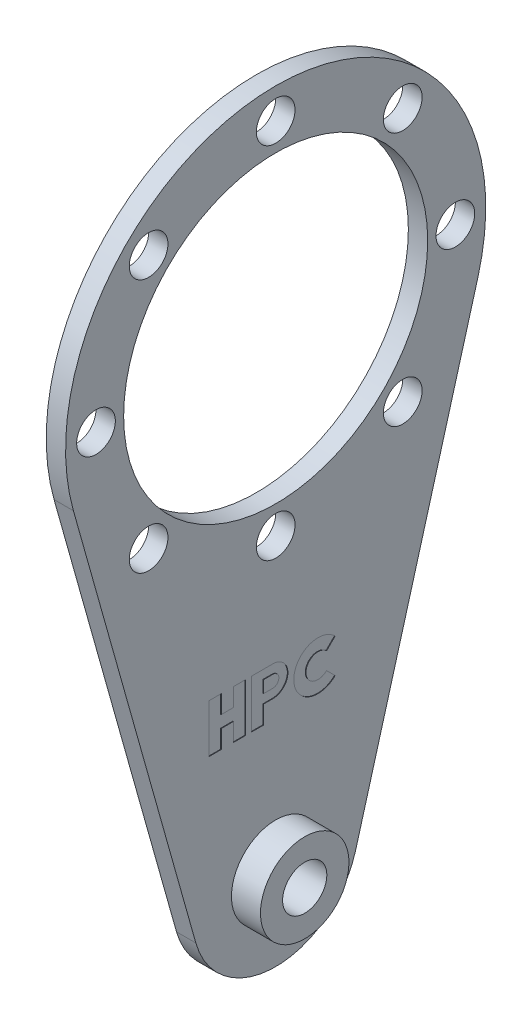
ISO-10303-21;
HEADER;
FILE_DESCRIPTION(('STEP AP214'),'2;1');
FILE_NAME('part.step','',(''),(''),'','','');
FILE_SCHEMA(('AUTOMOTIVE_DESIGN { 1 0 10303 214 1 1 1 1 }'));
ENDSEC;
DATA;
#1=APPLICATION_CONTEXT('core data for automotive mechanical design processes');
#2=APPLICATION_PROTOCOL_DEFINITION('international standard','automotive_design',2000,#1);
#3=PRODUCT_CONTEXT('',#1,'mechanical');
#4=PRODUCT('Part','Part','',(#3));
#5=PRODUCT_RELATED_PRODUCT_CATEGORY('part','',(#4));
#6=PRODUCT_DEFINITION_FORMATION('','',#4);
#7=PRODUCT_DEFINITION_CONTEXT('part definition',#1,'design');
#8=PRODUCT_DEFINITION('design','',#6,#7);
#9=PRODUCT_DEFINITION_SHAPE('','',#8);
#10=(LENGTH_UNIT() NAMED_UNIT(*) SI_UNIT(.MILLI.,.METRE.));
#11=(NAMED_UNIT(*) PLANE_ANGLE_UNIT() SI_UNIT($,.RADIAN.));
#12=(NAMED_UNIT(*) SI_UNIT($,.STERADIAN.) SOLID_ANGLE_UNIT());
#13=UNCERTAINTY_MEASURE_WITH_UNIT(LENGTH_MEASURE(1.E-05),#10,'distance_accuracy_value','');
#14=(GEOMETRIC_REPRESENTATION_CONTEXT(3) GLOBAL_UNCERTAINTY_ASSIGNED_CONTEXT((#13)) GLOBAL_UNIT_ASSIGNED_CONTEXT((#10,
#11,#12)) REPRESENTATION_CONTEXT('',''));
#15=CARTESIAN_POINT('',(0.,0.,0.));
#16=DIRECTION('',(0.,0.,1.));
#17=DIRECTION('',(1.,0.,0.));
#18=AXIS2_PLACEMENT_3D('',#15,#16,#17);
#19=CARTESIAN_POINT('',(-7.,-93.096,-8.09600000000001));
#20=DIRECTION('',(-1.,0.,0.));
#21=DIRECTION('',(0.,0.,1.));
#22=AXIS2_PLACEMENT_3D('',#19,#20,#21);
#23=PLANE('',#22);
#24=CARTESIAN_POINT('',(-7.,-85.,0.));
#25=DIRECTION('',(1.,0.,0.));
#26=DIRECTION('',(0.,1.,0.));
#27=AXIS2_PLACEMENT_3D('',#24,#25,#26);
#28=CIRCLE('',#27,4.);
#29=CARTESIAN_POINT('',(-7.,-81.,0.));
#30=VERTEX_POINT('',#29);
#31=EDGE_CURVE('E399',#30,#30,#28,.F.);
#32=ORIENTED_EDGE('',*,*,#31,.F.);
#33=EDGE_LOOP('',(#32));
#34=FACE_BOUND('',#33,.T.);
#35=CARTESIAN_POINT('',(-7.,-85.,0.));
#36=DIRECTION('',(1.,0.,0.));
#37=DIRECTION('',(0.,0.,-1.));
#38=AXIS2_PLACEMENT_3D('',#35,#36,#37);
#39=CIRCLE('',#38,8.00000000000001);
#40=CARTESIAN_POINT('',(-7.,-85.,-8.00000000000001));
#41=VERTEX_POINT('',#40);
#42=EDGE_CURVE('E402',#41,#41,#39,.T.);
#43=ORIENTED_EDGE('',*,*,#42,.F.);
#44=EDGE_LOOP('',(#43));
#45=FACE_BOUND('',#44,.T.);
#46=ADVANCED_FACE('F16',(#34,#45),#23,.T.);
#47=CARTESIAN_POINT('',(1.75,-56.1206666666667,2.184));
#48=DIRECTION('',(1.,0.,0.));
#49=DIRECTION('',(0.,0.,-1.));
#50=AXIS2_PLACEMENT_3D('',#47,#48,#49);
#51=PLANE('',#50);
#52=DIRECTION('',(0.,0.,-1.));
#53=VECTOR('',#52,1.);
#54=CARTESIAN_POINT('',(1.75,-56.1206666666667,0.796726));
#55=LINE('',#54,#53);
#56=CARTESIAN_POINT('',(1.75,-56.1206666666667,2.184));
#57=VERTEX_POINT('',#56);
#58=CARTESIAN_POINT('',(1.75,-56.1206666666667,0.518));
#59=VERTEX_POINT('',#58);
#60=EDGE_CURVE('E130',#57,#59,#55,.T.);
#61=ORIENTED_EDGE('',*,*,#60,.T.);
#62=CARTESIAN_POINT('',(1.75,-55.0286666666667,0.518));
#63=DIRECTION('',(1.,0.,0.));
#64=DIRECTION('',(0.,0.,-1.));
#65=AXIS2_PLACEMENT_3D('',#62,#63,#64);
#66=CIRCLE('',#65,1.092);
#67=CARTESIAN_POINT('',(1.75,-53.9366666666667,0.518000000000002));
#68=VERTEX_POINT('',#67);
#69=EDGE_CURVE('E19',#59,#68,#66,.T.);
#70=ORIENTED_EDGE('',*,*,#69,.T.);
#71=DIRECTION('',(0.,0.,1.));
#72=VECTOR('',#71,1.);
#73=CARTESIAN_POINT('',(1.75,-53.9366666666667,0.796726));
#74=LINE('',#73,#72);
#75=CARTESIAN_POINT('',(1.75,-53.9366666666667,2.184));
#76=VERTEX_POINT('',#75);
#77=EDGE_CURVE('E115',#68,#76,#74,.T.);
#78=ORIENTED_EDGE('',*,*,#77,.T.);
#79=DIRECTION('',(0.,1.,0.));
#80=VECTOR('',#79,1.);
#81=CARTESIAN_POINT('',(1.75,-56.1206666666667,2.184));
#82=LINE('',#81,#80);
#83=EDGE_CURVE('E401',#57,#76,#82,.T.);
#84=ORIENTED_EDGE('',*,*,#83,.F.);
#85=EDGE_LOOP('',(#61,#70,#78,#84));
#86=FACE_BOUND('',#85,.T.);
#87=ADVANCED_FACE('F639',(#86),#51,.T.);
#88=CARTESIAN_POINT('',(-1.75,-85.,0.));
#89=DIRECTION('',(1.,0.,0.));
#90=DIRECTION('',(0.,0.,-1.));
#91=AXIS2_PLACEMENT_3D('',#88,#89,#90);
#92=CYLINDRICAL_SURFACE('',#91,8.00000000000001);
#93=CARTESIAN_POINT('',(-1.75,-85.,0.));
#94=DIRECTION('',(1.,0.,0.));
#95=DIRECTION('',(0.,0.,-1.));
#96=AXIS2_PLACEMENT_3D('',#93,#94,#95);
#97=CIRCLE('',#96,8.00000000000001);
#98=CARTESIAN_POINT('',(-1.75,-85.,-8.00000000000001));
#99=VERTEX_POINT('',#98);
#100=EDGE_CURVE('E395',#99,#99,#97,.T.);
#101=ORIENTED_EDGE('',*,*,#100,.F.);
#102=EDGE_LOOP('',(#101));
#103=FACE_BOUND('',#102,.T.);
#104=ORIENTED_EDGE('',*,*,#42,.T.);
#105=EDGE_LOOP('',(#104));
#106=FACE_BOUND('',#105,.T.);
#107=ADVANCED_FACE('F641',(#103,#106),#92,.T.);
#108=CARTESIAN_POINT('',(-7.,-85.,0.));
#109=DIRECTION('',(1.,0.,0.));
#110=DIRECTION('',(0.,1.,0.));
#111=AXIS2_PLACEMENT_3D('',#108,#109,#110);
#112=CYLINDRICAL_SURFACE('',#111,4.);
#113=CARTESIAN_POINT('',(7.,-85.,0.));
#114=DIRECTION('',(1.,0.,0.));
#115=DIRECTION('',(0.,1.,0.));
#116=AXIS2_PLACEMENT_3D('',#113,#114,#115);
#117=CIRCLE('',#116,4.);
#118=CARTESIAN_POINT('',(7.,-81.,0.));
#119=VERTEX_POINT('',#118);
#120=EDGE_CURVE('E391',#119,#119,#117,.F.);
#121=ORIENTED_EDGE('',*,*,#120,.F.);
#122=EDGE_LOOP('',(#121));
#123=FACE_BOUND('',#122,.T.);
#124=ORIENTED_EDGE('',*,*,#31,.T.);
#125=EDGE_LOOP('',(#124));
#126=FACE_BOUND('',#125,.T.);
#127=ADVANCED_FACE('F646',(#123,#126),#112,.F.);
#128=CARTESIAN_POINT('',(1.65,-56.1206666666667,2.184));
#129=DIRECTION('',(0.,0.,1.));
#130=DIRECTION('',(1.,0.,0.));
#131=AXIS2_PLACEMENT_3D('',#128,#129,#130);
#132=PLANE('',#131);
#133=DIRECTION('',(0.,1.,0.));
#134=VECTOR('',#133,1.);
#135=CARTESIAN_POINT('',(1.65,-61.0486666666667,2.18399999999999));
#136=LINE('',#135,#134);
#137=CARTESIAN_POINT('',(1.65,-56.1206666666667,2.18399999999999));
#138=VERTEX_POINT('',#137);
#139=CARTESIAN_POINT('',(1.65,-53.9366666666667,2.18399999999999));
#140=VERTEX_POINT('',#139);
#141=EDGE_CURVE('E394',#138,#140,#136,.T.);
#142=ORIENTED_EDGE('',*,*,#141,.F.);
#143=DIRECTION('',(1.,0.,0.));
#144=VECTOR('',#143,1.);
#145=CARTESIAN_POINT('',(1.65,-56.1206666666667,2.184));
#146=LINE('',#145,#144);
#147=EDGE_CURVE('E620',#57,#138,#146,.F.);
#148=ORIENTED_EDGE('',*,*,#147,.F.);
#149=ORIENTED_EDGE('',*,*,#83,.T.);
#150=DIRECTION('',(1.,0.,0.));
#151=VECTOR('',#150,1.);
#152=CARTESIAN_POINT('',(1.65,-53.9366666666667,2.184));
#153=LINE('',#152,#151);
#154=EDGE_CURVE('E623',#140,#76,#153,.T.);
#155=ORIENTED_EDGE('',*,*,#154,.F.);
#156=EDGE_LOOP('',(#142,#148,#149,#155));
#157=FACE_BOUND('',#156,.T.);
#158=ADVANCED_FACE('F638',(#157),#132,.T.);
#159=CARTESIAN_POINT('',(1.65,-53.9366666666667,0.518));
#160=DIRECTION('',(0.,1.,0.));
#161=DIRECTION('',(0.,0.,1.));
#162=AXIS2_PLACEMENT_3D('',#159,#160,#161);
#163=PLANE('',#162);
#164=DIRECTION('',(0.,0.,-1.));
#165=VECTOR('',#164,1.);
#166=CARTESIAN_POINT('',(1.65,-53.9366666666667,1.05826));
#167=LINE('',#166,#165);
#168=CARTESIAN_POINT('',(1.65,-53.9366666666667,0.518000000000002));
#169=VERTEX_POINT('',#168);
#170=EDGE_CURVE('E390',#140,#169,#167,.T.);
#171=ORIENTED_EDGE('',*,*,#170,.F.);
#172=ORIENTED_EDGE('',*,*,#154,.T.);
#173=ORIENTED_EDGE('',*,*,#77,.F.);
#174=DIRECTION('',(1.,0.,0.));
#175=VECTOR('',#174,1.);
#176=CARTESIAN_POINT('',(1.7,-53.9366666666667,0.518000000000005));
#177=LINE('',#176,#175);
#178=EDGE_CURVE('E621',#169,#68,#177,.T.);
#179=ORIENTED_EDGE('',*,*,#178,.F.);
#180=EDGE_LOOP('',(#171,#172,#173,#179));
#181=FACE_BOUND('',#180,.T.);
#182=ADVANCED_FACE('F637',(#181),#163,.T.);
#183=CARTESIAN_POINT('',(1.75,-55.0286666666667,0.518));
#184=DIRECTION('',(1.,0.,0.));
#185=DIRECTION('',(0.,0.,-1.));
#186=AXIS2_PLACEMENT_3D('',#183,#184,#185);
#187=CYLINDRICAL_SURFACE('',#186,1.092);
#188=ORIENTED_EDGE('',*,*,#69,.F.);
#189=DIRECTION('',(1.,0.,0.));
#190=VECTOR('',#189,1.);
#191=CARTESIAN_POINT('',(1.65,-56.1206666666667,0.518));
#192=LINE('',#191,#190);
#193=CARTESIAN_POINT('',(1.65,-56.1206666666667,0.518));
#194=VERTEX_POINT('',#193);
#195=EDGE_CURVE('E398',#194,#59,#192,.T.);
#196=ORIENTED_EDGE('',*,*,#195,.F.);
#197=CARTESIAN_POINT('',(1.65,-55.0286666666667,0.518));
#198=DIRECTION('',(1.,0.,0.));
#199=DIRECTION('',(0.,0.,-1.));
#200=AXIS2_PLACEMENT_3D('',#197,#198,#199);
#201=CIRCLE('',#200,1.092);
#202=EDGE_CURVE('E386',#169,#194,#201,.F.);
#203=ORIENTED_EDGE('',*,*,#202,.F.);
#204=ORIENTED_EDGE('',*,*,#178,.T.);
#205=EDGE_LOOP('',(#188,#196,#203,#204));
#206=FACE_BOUND('',#205,.T.);
#207=ADVANCED_FACE('F636',(#206),#187,.T.);
#208=CARTESIAN_POINT('',(1.65,-56.1206666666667,2.184));
#209=DIRECTION('',(0.,-1.,0.));
#210=DIRECTION('',(0.,0.,-1.));
#211=AXIS2_PLACEMENT_3D('',#208,#209,#210);
#212=PLANE('',#211);
#213=DIRECTION('',(0.,0.,1.));
#214=VECTOR('',#213,1.);
#215=CARTESIAN_POINT('',(1.65,-56.1206666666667,1.05826));
#216=LINE('',#215,#214);
#217=EDGE_CURVE('E389',#194,#138,#216,.T.);
#218=ORIENTED_EDGE('',*,*,#217,.F.);
#219=ORIENTED_EDGE('',*,*,#195,.T.);
#220=ORIENTED_EDGE('',*,*,#60,.F.);
#221=ORIENTED_EDGE('',*,*,#147,.T.);
#222=EDGE_LOOP('',(#218,#219,#220,#221));
#223=FACE_BOUND('',#222,.T.);
#224=ADVANCED_FACE('F630',(#223),#212,.T.);
#225=CARTESIAN_POINT('',(-1.75,-100.828266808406,-38.456));
#226=DIRECTION('',(-1.,0.,0.));
#227=DIRECTION('',(0.,0.,1.));
#228=AXIS2_PLACEMENT_3D('',#225,#226,#227);
#229=PLANE('',#228);
#230=CARTESIAN_POINT('',(-1.75,0.,-32.5));
#231=DIRECTION('',(-1.,0.,0.));
#232=DIRECTION('',(0.,0.,1.));
#233=AXIS2_PLACEMENT_3D('',#230,#231,#232);
#234=CIRCLE('',#233,3.50000000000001);
#235=CARTESIAN_POINT('',(-1.75,0.,-29.));
#236=VERTEX_POINT('',#235);
#237=EDGE_CURVE('E372',#236,#236,#234,.T.);
#238=ORIENTED_EDGE('',*,*,#237,.F.);
#239=EDGE_LOOP('',(#238));
#240=FACE_BOUND('',#239,.T.);
#241=CARTESIAN_POINT('',(-1.75,22.9809703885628,-22.9809703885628));
#242=DIRECTION('',(-1.,0.,0.));
#243=DIRECTION('',(0.,0.,1.));
#244=AXIS2_PLACEMENT_3D('',#241,#242,#243);
#245=CIRCLE('',#244,3.5);
#246=CARTESIAN_POINT('',(-1.75,22.9809703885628,-19.4809703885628));
#247=VERTEX_POINT('',#246);
#248=EDGE_CURVE('E369',#247,#247,#245,.T.);
#249=ORIENTED_EDGE('',*,*,#248,.F.);
#250=EDGE_LOOP('',(#249));
#251=FACE_BOUND('',#250,.T.);
#252=CARTESIAN_POINT('',(-1.75,-22.9809703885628,-22.9809703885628));
#253=DIRECTION('',(-1.,0.,0.));
#254=DIRECTION('',(0.,0.,1.));
#255=AXIS2_PLACEMENT_3D('',#252,#253,#254);
#256=CIRCLE('',#255,3.49999999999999);
#257=CARTESIAN_POINT('',(-1.75,-22.9809703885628,-19.4809703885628));
#258=VERTEX_POINT('',#257);
#259=EDGE_CURVE('E366',#258,#258,#256,.T.);
#260=ORIENTED_EDGE('',*,*,#259,.F.);
#261=EDGE_LOOP('',(#260));
#262=FACE_BOUND('',#261,.T.);
#263=CARTESIAN_POINT('',(-1.75,32.5,0.));
#264=DIRECTION('',(-1.,0.,0.));
#265=DIRECTION('',(0.,0.,1.));
#266=AXIS2_PLACEMENT_3D('',#263,#264,#265);
#267=CIRCLE('',#266,3.5);
#268=CARTESIAN_POINT('',(-1.75,32.5,3.5));
#269=VERTEX_POINT('',#268);
#270=EDGE_CURVE('E363',#269,#269,#267,.T.);
#271=ORIENTED_EDGE('',*,*,#270,.F.);
#272=EDGE_LOOP('',(#271));
#273=FACE_BOUND('',#272,.T.);
#274=CARTESIAN_POINT('',(-1.75,-32.5,0.));
#275=DIRECTION('',(-1.,0.,0.));
#276=DIRECTION('',(0.,0.,1.));
#277=AXIS2_PLACEMENT_3D('',#274,#275,#276);
#278=CIRCLE('',#277,3.5);
#279=CARTESIAN_POINT('',(-1.75,-32.5,3.50000000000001));
#280=VERTEX_POINT('',#279);
#281=EDGE_CURVE('E360',#280,#280,#278,.T.);
#282=ORIENTED_EDGE('',*,*,#281,.F.);
#283=EDGE_LOOP('',(#282));
#284=FACE_BOUND('',#283,.T.);
#285=CARTESIAN_POINT('',(-1.75,-22.9809703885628,22.9809703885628));
#286=DIRECTION('',(-1.,0.,0.));
#287=DIRECTION('',(0.,0.,1.));
#288=AXIS2_PLACEMENT_3D('',#285,#286,#287);
#289=CIRCLE('',#288,3.5);
#290=CARTESIAN_POINT('',(-1.75,-22.9809703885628,26.4809703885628));
#291=VERTEX_POINT('',#290);
#292=EDGE_CURVE('E357',#291,#291,#289,.T.);
#293=ORIENTED_EDGE('',*,*,#292,.F.);
#294=EDGE_LOOP('',(#293));
#295=FACE_BOUND('',#294,.T.);
#296=CARTESIAN_POINT('',(-1.75,22.9809703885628,22.9809703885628));
#297=DIRECTION('',(-1.,0.,0.));
#298=DIRECTION('',(0.,0.,1.));
#299=AXIS2_PLACEMENT_3D('',#296,#297,#298);
#300=CIRCLE('',#299,3.5);
#301=CARTESIAN_POINT('',(-1.75,22.9809703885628,26.4809703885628));
#302=VERTEX_POINT('',#301);
#303=EDGE_CURVE('E354',#302,#302,#300,.T.);
#304=ORIENTED_EDGE('',*,*,#303,.F.);
#305=EDGE_LOOP('',(#304));
#306=FACE_BOUND('',#305,.T.);
#307=CARTESIAN_POINT('',(-1.75,0.,0.));
#308=DIRECTION('',(-1.,0.,0.));
#309=DIRECTION('',(0.,0.,1.));
#310=AXIS2_PLACEMENT_3D('',#307,#308,#309);
#311=CIRCLE('',#310,27.5);
#312=CARTESIAN_POINT('',(-1.75,0.,27.5));
#313=VERTEX_POINT('',#312);
#314=EDGE_CURVE('E351',#313,#313,#311,.T.);
#315=ORIENTED_EDGE('',*,*,#314,.F.);
#316=EDGE_LOOP('',(#315));
#317=FACE_BOUND('',#316,.T.);
#318=CARTESIAN_POINT('',(-1.75,0.,32.5));
#319=DIRECTION('',(-1.,0.,0.));
#320=DIRECTION('',(0.,0.,1.));
#321=AXIS2_PLACEMENT_3D('',#318,#319,#320);
#322=CIRCLE('',#321,3.5);
#323=CARTESIAN_POINT('',(-1.75,0.,36.));
#324=VERTEX_POINT('',#323);
#325=EDGE_CURVE('E348',#324,#324,#322,.T.);
#326=ORIENTED_EDGE('',*,*,#325,.F.);
#327=EDGE_LOOP('',(#326));
#328=FACE_BOUND('',#327,.T.);
#329=ORIENTED_EDGE('',*,*,#100,.T.);
#330=EDGE_LOOP('',(#329));
#331=FACE_BOUND('',#330,.T.);
#332=CARTESIAN_POINT('',(-1.75,0.,0.));
#333=DIRECTION('',(-1.,0.,0.));
#334=DIRECTION('',(0.,0.,1.));
#335=AXIS2_PLACEMENT_3D('',#332,#333,#334);
#336=CIRCLE('',#335,38.);
#337=CARTESIAN_POINT('',(-1.75,-10.2823529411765,-36.5824167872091));
#338=VERTEX_POINT('',#337);
#339=CARTESIAN_POINT('',(-1.75,-10.2823529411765,36.5824167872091));
#340=VERTEX_POINT('',#339);
#341=EDGE_CURVE('E381',#338,#340,#336,.F.);
#342=ORIENTED_EDGE('',*,*,#341,.F.);
#343=DIRECTION('',(0.,0.962695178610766,-0.270588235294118));
#344=VECTOR('',#343,1.);
#345=CARTESIAN_POINT('',(-1.75,-49.6705882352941,-25.5114222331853));
#346=LINE('',#345,#344);
#347=CARTESIAN_POINT('',(-1.75,-89.0588235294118,-14.4404276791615));
#348=VERTEX_POINT('',#347);
#349=EDGE_CURVE('E596',#348,#338,#346,.T.);
#350=ORIENTED_EDGE('',*,*,#349,.F.);
#351=CARTESIAN_POINT('',(-1.75,-85.,0.));
#352=DIRECTION('',(-1.,0.,0.));
#353=DIRECTION('',(0.,0.,1.));
#354=AXIS2_PLACEMENT_3D('',#351,#352,#353);
#355=CIRCLE('',#354,15.);
#356=CARTESIAN_POINT('',(-1.75,-89.0588235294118,14.4404276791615));
#357=VERTEX_POINT('',#356);
#358=EDGE_CURVE('E376',#357,#348,#355,.F.);
#359=ORIENTED_EDGE('',*,*,#358,.F.);
#360=DIRECTION('',(0.,-0.962695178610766,-0.270588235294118));
#361=VECTOR('',#360,1.);
#362=CARTESIAN_POINT('',(-1.75,-49.6705882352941,25.5114222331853));
#363=LINE('',#362,#361);
#364=EDGE_CURVE('E384',#340,#357,#363,.T.);
#365=ORIENTED_EDGE('',*,*,#364,.F.);
#366=EDGE_LOOP('',(#342,#350,#359,#365));
#367=FACE_BOUND('',#366,.T.);
#368=ADVANCED_FACE('F662',(#240,#251,#262,#273,#284,#295,#306,#317,#328,#331,#367),#229,.T.);
#369=CARTESIAN_POINT('',(7.,-93.096,8.09600000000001));
#370=DIRECTION('',(1.,0.,0.));
#371=DIRECTION('',(0.,0.,-1.));
#372=AXIS2_PLACEMENT_3D('',#369,#370,#371);
#373=PLANE('',#372);
#374=ORIENTED_EDGE('',*,*,#120,.T.);
#375=EDGE_LOOP('',(#374));
#376=FACE_BOUND('',#375,.T.);
#377=CARTESIAN_POINT('',(7.,-85.,0.));
#378=DIRECTION('',(1.,0.,0.));
#379=DIRECTION('',(0.,1.,0.));
#380=AXIS2_PLACEMENT_3D('',#377,#378,#379);
#381=CIRCLE('',#380,8.00000000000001);
#382=CARTESIAN_POINT('',(7.,-77.,0.));
#383=VERTEX_POINT('',#382);
#384=EDGE_CURVE('E344',#383,#383,#381,.F.);
#385=ORIENTED_EDGE('',*,*,#384,.F.);
#386=EDGE_LOOP('',(#385));
#387=FACE_BOUND('',#386,.T.);
#388=ADVANCED_FACE('F665',(#376,#387),#373,.T.);
#389=CARTESIAN_POINT('',(1.65,-61.0486666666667,12.026));
#390=DIRECTION('',(1.,0.,0.));
#391=DIRECTION('',(0.,0.,-1.));
#392=AXIS2_PLACEMENT_3D('',#389,#390,#391);
#393=PLANE('',#392);
#394=DIRECTION('',(0.,1.,0.));
#395=VECTOR('',#394,1.);
#396=CARTESIAN_POINT('',(1.65,-55.5746666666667,9.842));
#397=LINE('',#396,#395);
#398=CARTESIAN_POINT('',(1.65,-52.2986666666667,9.842));
#399=VERTEX_POINT('',#398);
#400=CARTESIAN_POINT('',(1.65,-55.5746666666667,9.842));
#401=VERTEX_POINT('',#400);
#402=EDGE_CURVE('E571',#399,#401,#397,.F.);
#403=ORIENTED_EDGE('',*,*,#402,.F.);
#404=DIRECTION('',(0.,0.,-1.));
#405=VECTOR('',#404,1.);
#406=CARTESIAN_POINT('',(1.65,-52.2986666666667,10.934));
#407=LINE('',#406,#405);
#408=CARTESIAN_POINT('',(1.65,-52.2986666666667,12.026));
#409=VERTEX_POINT('',#408);
#410=EDGE_CURVE('E576',#409,#399,#407,.T.);
#411=ORIENTED_EDGE('',*,*,#410,.F.);
#412=DIRECTION('',(0.,1.,0.));
#413=VECTOR('',#412,1.);
#414=CARTESIAN_POINT('',(1.65,-61.0486666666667,12.026));
#415=LINE('',#414,#413);
#416=CARTESIAN_POINT('',(1.65,-61.0486666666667,12.026));
#417=VERTEX_POINT('',#416);
#418=EDGE_CURVE('E347',#417,#409,#415,.T.);
#419=ORIENTED_EDGE('',*,*,#418,.F.);
#420=DIRECTION('',(0.,0.,1.));
#421=VECTOR('',#420,1.);
#422=CARTESIAN_POINT('',(1.65,-61.0486666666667,10.934));
#423=LINE('',#422,#421);
#424=CARTESIAN_POINT('',(1.65,-61.0486666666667,9.842));
#425=VERTEX_POINT('',#424);
#426=EDGE_CURVE('E238',#425,#417,#423,.T.);
#427=ORIENTED_EDGE('',*,*,#426,.F.);
#428=DIRECTION('',(0.,1.,0.));
#429=VECTOR('',#428,1.);
#430=CARTESIAN_POINT('',(1.65,-61.0486666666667,9.842));
#431=LINE('',#430,#429);
#432=CARTESIAN_POINT('',(1.65,-57.7586666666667,9.842));
#433=VERTEX_POINT('',#432);
#434=EDGE_CURVE('E234',#433,#425,#431,.F.);
#435=ORIENTED_EDGE('',*,*,#434,.F.);
#436=DIRECTION('',(0.,0.,1.));
#437=VECTOR('',#436,1.);
#438=CARTESIAN_POINT('',(1.65,-57.7586666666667,8.75));
#439=LINE('',#438,#437);
#440=CARTESIAN_POINT('',(1.65,-57.7586666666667,7.65799999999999));
#441=VERTEX_POINT('',#440);
#442=EDGE_CURVE('E536',#441,#433,#439,.T.);
#443=ORIENTED_EDGE('',*,*,#442,.F.);
#444=DIRECTION('',(0.,1.,0.));
#445=VECTOR('',#444,1.);
#446=CARTESIAN_POINT('',(1.65,-61.0486666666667,7.658));
#447=LINE('',#446,#445);
#448=CARTESIAN_POINT('',(1.65,-61.0486666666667,7.65799999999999));
#449=VERTEX_POINT('',#448);
#450=EDGE_CURVE('E541',#449,#441,#447,.T.);
#451=ORIENTED_EDGE('',*,*,#450,.F.);
#452=DIRECTION('',(0.,0.,1.));
#453=VECTOR('',#452,1.);
#454=CARTESIAN_POINT('',(1.65,-61.0486666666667,6.559));
#455=LINE('',#454,#453);
#456=CARTESIAN_POINT('',(1.65,-61.0486666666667,5.46));
#457=VERTEX_POINT('',#456);
#458=EDGE_CURVE('E546',#457,#449,#455,.T.);
#459=ORIENTED_EDGE('',*,*,#458,.F.);
#460=DIRECTION('',(0.,1.,0.));
#461=VECTOR('',#460,1.);
#462=CARTESIAN_POINT('',(1.65,-61.0486666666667,5.46));
#463=LINE('',#462,#461);
#464=CARTESIAN_POINT('',(1.65,-52.2986666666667,5.46));
#465=VERTEX_POINT('',#464);
#466=EDGE_CURVE('E551',#465,#457,#463,.F.);
#467=ORIENTED_EDGE('',*,*,#466,.F.);
#468=DIRECTION('',(0.,0.,-1.));
#469=VECTOR('',#468,1.);
#470=CARTESIAN_POINT('',(1.65,-52.2986666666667,6.559));
#471=LINE('',#470,#469);
#472=CARTESIAN_POINT('',(1.65,-52.2986666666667,7.65799999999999));
#473=VERTEX_POINT('',#472);
#474=EDGE_CURVE('E556',#473,#465,#471,.T.);
#475=ORIENTED_EDGE('',*,*,#474,.F.);
#476=DIRECTION('',(0.,1.,0.));
#477=VECTOR('',#476,1.);
#478=CARTESIAN_POINT('',(1.65,-55.5746666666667,7.658));
#479=LINE('',#478,#477);
#480=CARTESIAN_POINT('',(1.65,-55.5746666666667,7.65799999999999));
#481=VERTEX_POINT('',#480);
#482=EDGE_CURVE('E561',#481,#473,#479,.T.);
#483=ORIENTED_EDGE('',*,*,#482,.F.);
#484=DIRECTION('',(0.,0.,-1.));
#485=VECTOR('',#484,1.);
#486=CARTESIAN_POINT('',(1.65,-55.5746666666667,8.75));
#487=LINE('',#486,#485);
#488=EDGE_CURVE('E566',#401,#481,#487,.T.);
#489=ORIENTED_EDGE('',*,*,#488,.F.);
#490=EDGE_LOOP('',(#403,#411,#419,#427,#435,#443,#451,#459,#467,#475,#483,#489));
#491=FACE_BOUND('',#490,.T.);
#492=ADVANCED_FACE('F669',(#491),#393,.T.);
#493=CARTESIAN_POINT('',(1.65,-61.0486666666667,4.368));
#494=DIRECTION('',(1.,0.,0.));
#495=DIRECTION('',(0.,0.,-1.));
#496=AXIS2_PLACEMENT_3D('',#493,#494,#495);
#497=PLANE('',#496);
#498=ORIENTED_EDGE('',*,*,#202,.T.);
#499=ORIENTED_EDGE('',*,*,#217,.T.);
#500=ORIENTED_EDGE('',*,*,#141,.T.);
#501=ORIENTED_EDGE('',*,*,#170,.T.);
#502=EDGE_LOOP('',(#498,#499,#500,#501));
#503=FACE_BOUND('',#502,.T.);
#504=CARTESIAN_POINT('',(1.65,-55.0286666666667,0.518));
#505=DIRECTION('',(1.,0.,0.));
#506=DIRECTION('',(0.,1.,0.));
#507=AXIS2_PLACEMENT_3D('',#504,#505,#506);
#508=CIRCLE('',#507,2.73);
#509=CARTESIAN_POINT('',(1.65,-52.2986666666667,0.518000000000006));
#510=VERTEX_POINT('',#509);
#511=CARTESIAN_POINT('',(1.65,-57.7586666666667,0.518));
#512=VERTEX_POINT('',#511);
#513=EDGE_CURVE('E340',#510,#512,#508,.F.);
#514=ORIENTED_EDGE('',*,*,#513,.F.);
#515=DIRECTION('',(0.,0.,-1.));
#516=VECTOR('',#515,1.);
#517=CARTESIAN_POINT('',(1.65,-52.2986666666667,2.443));
#518=LINE('',#517,#516);
#519=CARTESIAN_POINT('',(1.65,-52.2986666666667,4.368));
#520=VERTEX_POINT('',#519);
#521=EDGE_CURVE('E517',#520,#510,#518,.T.);
#522=ORIENTED_EDGE('',*,*,#521,.F.);
#523=DIRECTION('',(0.,1.,0.));
#524=VECTOR('',#523,1.);
#525=CARTESIAN_POINT('',(1.65,-61.0486666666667,4.368));
#526=LINE('',#525,#524);
#527=CARTESIAN_POINT('',(1.65,-61.0486666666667,4.368));
#528=VERTEX_POINT('',#527);
#529=EDGE_CURVE('E523',#528,#520,#526,.T.);
#530=ORIENTED_EDGE('',*,*,#529,.F.);
#531=DIRECTION('',(0.,0.,1.));
#532=VECTOR('',#531,1.);
#533=CARTESIAN_POINT('',(1.65,-61.0486666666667,3.276));
#534=LINE('',#533,#532);
#535=CARTESIAN_POINT('',(1.65,-61.0486666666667,2.184));
#536=VERTEX_POINT('',#535);
#537=EDGE_CURVE('E528',#536,#528,#534,.T.);
#538=ORIENTED_EDGE('',*,*,#537,.F.);
#539=DIRECTION('',(0.,1.,0.));
#540=VECTOR('',#539,1.);
#541=CARTESIAN_POINT('',(1.65,-61.0486666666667,2.184));
#542=LINE('',#541,#540);
#543=CARTESIAN_POINT('',(1.65,-57.7586666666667,2.184));
#544=VERTEX_POINT('',#543);
#545=EDGE_CURVE('E603',#544,#536,#542,.F.);
#546=ORIENTED_EDGE('',*,*,#545,.F.);
#547=DIRECTION('',(0.,0.,1.));
#548=VECTOR('',#547,1.);
#549=CARTESIAN_POINT('',(1.65,-57.7586666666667,1.351));
#550=LINE('',#549,#548);
#551=EDGE_CURVE('E514',#512,#544,#550,.T.);
#552=ORIENTED_EDGE('',*,*,#551,.F.);
#553=EDGE_LOOP('',(#514,#522,#530,#538,#546,#552));
#554=FACE_BOUND('',#553,.T.);
#555=ADVANCED_FACE('F633',(#503,#554),#497,.T.);
#556=CARTESIAN_POINT('',(-1.75,-89.0588235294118,-14.4404276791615));
#557=DIRECTION('',(0.,-0.270588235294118,-0.962695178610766));
#558=DIRECTION('',(0.,0.962695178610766,-0.270588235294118));
#559=AXIS2_PLACEMENT_3D('',#556,#557,#558);
#560=PLANE('',#559);
#561=CARTESIAN_POINT('',(1.75,-89.0588235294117,-14.4404276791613));
#562=CARTESIAN_POINT('',(1.75,-85.7764705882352,-15.3630105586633));
#563=CARTESIAN_POINT('',(1.75,-82.4941176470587,-16.2855934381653));
#564=CARTESIAN_POINT('',(1.75,-75.9294117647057,-18.1307591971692));
#565=CARTESIAN_POINT('',(1.75,-72.6470588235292,-19.0533420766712));
#566=CARTESIAN_POINT('',(1.75,-66.0823529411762,-20.8985078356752));
#567=CARTESIAN_POINT('',(1.75,-62.7999999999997,-21.8210907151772));
#568=CARTESIAN_POINT('',(1.75,-56.2352941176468,-23.6662564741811));
#569=CARTESIAN_POINT('',(1.75,-52.9529411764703,-24.5888393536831));
#570=CARTESIAN_POINT('',(1.75,-46.3882352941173,-26.4340051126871));
#571=CARTESIAN_POINT('',(1.75,-43.1058823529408,-27.356587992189));
#572=CARTESIAN_POINT('',(1.75,-36.5411764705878,-29.201753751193));
#573=CARTESIAN_POINT('',(1.75,-33.2588235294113,-30.124336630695));
#574=CARTESIAN_POINT('',(1.75,-26.6941176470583,-31.969502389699));
#575=CARTESIAN_POINT('',(1.75,-23.4117647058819,-32.8920852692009));
#576=CARTESIAN_POINT('',(1.75,-16.8470588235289,-34.7372510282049));
#577=CARTESIAN_POINT('',(1.75,-13.5647058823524,-35.6598339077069));
#578=CARTESIAN_POINT('',(1.75,-10.2823529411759,-36.5824167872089));
#579=B_SPLINE_CURVE_WITH_KNOTS('',3,(#561,#562,#563,#564,#565,#566,#567,#568,#569,#570,#571,
#572,#573,#574,#575,#576,#577,#578),.UNSPECIFIED.,.F.,.F.,(4,2,2,2,2,2,2,2,4),(0.,
10.2286362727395,20.4572725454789,30.6859088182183,40.9145450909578,51.1431813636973,
61.3718176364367,71.6004539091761,81.8290901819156),.UNSPECIFIED.);
#580=CARTESIAN_POINT('',(1.75,-89.0588218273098,-14.4404281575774));
#581=VERTEX_POINT('',#580);
#582=CARTESIAN_POINT('',(1.75,-10.2823529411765,-36.5824167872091));
#583=VERTEX_POINT('',#582);
#584=EDGE_CURVE('E335',#581,#583,#579,.T.);
#585=ORIENTED_EDGE('',*,*,#584,.F.);
#586=DIRECTION('',(1.,0.,0.));
#587=VECTOR('',#586,1.);
#588=CARTESIAN_POINT('',(0.,-89.0588235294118,-14.4404276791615));
#589=LINE('',#588,#587);
#590=EDGE_CURVE('E379',#348,#581,#589,.T.);
#591=ORIENTED_EDGE('',*,*,#590,.F.);
#592=ORIENTED_EDGE('',*,*,#349,.T.);
#593=DIRECTION('',(-1.,0.,0.));
#594=VECTOR('',#593,1.);
#595=CARTESIAN_POINT('',(0.,-10.2823529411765,-36.5824167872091));
#596=LINE('',#595,#594);
#597=EDGE_CURVE('E385',#583,#338,#596,.T.);
#598=ORIENTED_EDGE('',*,*,#597,.F.);
#599=EDGE_LOOP('',(#585,#591,#592,#598));
#600=FACE_BOUND('',#599,.T.);
#601=ADVANCED_FACE('F676',(#600),#560,.T.);
#602=CARTESIAN_POINT('',(-1.75,0.,0.));
#603=DIRECTION('',(-1.,0.,0.));
#604=DIRECTION('',(0.,0.,1.));
#605=AXIS2_PLACEMENT_3D('',#602,#603,#604);
#606=CYLINDRICAL_SURFACE('',#605,38.);
#607=ORIENTED_EDGE('',*,*,#341,.T.);
#608=DIRECTION('',(1.,0.,0.));
#609=VECTOR('',#608,1.);
#610=CARTESIAN_POINT('',(-1.75,-10.2823529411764,36.5824167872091));
#611=LINE('',#610,#609);
#612=CARTESIAN_POINT('',(1.75,-10.2823529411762,36.582416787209));
#613=VERTEX_POINT('',#612);
#614=EDGE_CURVE('E380',#613,#340,#611,.F.);
#615=ORIENTED_EDGE('',*,*,#614,.F.);
#616=CARTESIAN_POINT('',(1.75,0.,0.));
#617=DIRECTION('',(-1.,0.,0.));
#618=DIRECTION('',(0.,0.,1.));
#619=AXIS2_PLACEMENT_3D('',#616,#617,#618);
#620=CIRCLE('',#619,38.);
#621=EDGE_CURVE('E323',#583,#613,#620,.F.);
#622=ORIENTED_EDGE('',*,*,#621,.F.);
#623=ORIENTED_EDGE('',*,*,#597,.T.);
#624=EDGE_LOOP('',(#607,#615,#622,#623));
#625=FACE_BOUND('',#624,.T.);
#626=ADVANCED_FACE('F679',(#625),#606,.T.);
#627=CARTESIAN_POINT('',(-1.75,-10.2823529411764,36.5824167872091));
#628=DIRECTION('',(0.,-0.270588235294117,0.962695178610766));
#629=DIRECTION('',(0.,-0.962695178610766,-0.270588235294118));
#630=AXIS2_PLACEMENT_3D('',#627,#628,#629);
#631=PLANE('',#630);
#632=CARTESIAN_POINT('',(1.75,-10.2823529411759,36.5824167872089));
#633=CARTESIAN_POINT('',(1.75,-13.5647058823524,35.6598339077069));
#634=CARTESIAN_POINT('',(1.75,-16.8470588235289,34.7372510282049));
#635=CARTESIAN_POINT('',(1.75,-23.4117647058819,32.8920852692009));
#636=CARTESIAN_POINT('',(1.75,-26.6941176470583,31.9695023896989));
#637=CARTESIAN_POINT('',(1.75,-33.2588235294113,30.124336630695));
#638=CARTESIAN_POINT('',(1.75,-36.5411764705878,29.201753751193));
#639=CARTESIAN_POINT('',(1.75,-43.1058823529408,27.356587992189));
#640=CARTESIAN_POINT('',(1.75,-46.3882352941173,26.434005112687));
#641=CARTESIAN_POINT('',(1.75,-52.9529411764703,24.5888393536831));
#642=CARTESIAN_POINT('',(1.75,-56.2352941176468,23.6662564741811));
#643=CARTESIAN_POINT('',(1.75,-62.7999999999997,21.8210907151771));
#644=CARTESIAN_POINT('',(1.75,-66.0823529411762,20.8985078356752));
#645=CARTESIAN_POINT('',(1.75,-72.6470588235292,19.0533420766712));
#646=CARTESIAN_POINT('',(1.75,-75.9294117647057,18.1307591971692));
#647=CARTESIAN_POINT('',(1.75,-82.4941176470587,16.2855934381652));
#648=CARTESIAN_POINT('',(1.75,-85.7764705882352,15.3630105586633));
#649=CARTESIAN_POINT('',(1.75,-89.0588235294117,14.4404276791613));
#650=B_SPLINE_CURVE_WITH_KNOTS('',3,(#632,#633,#634,#635,#636,#637,#638,#639,#640,#641,#642,
#643,#644,#645,#646,#647,#648,#649),.UNSPECIFIED.,.F.,.F.,(4,2,2,2,2,2,2,2,4),(0.,
10.2286362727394,20.4572725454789,30.6859088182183,40.9145450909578,51.1431813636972,
61.3718176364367,71.6004539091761,81.8290901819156),.UNSPECIFIED.);
#651=CARTESIAN_POINT('',(1.75,-89.0588235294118,14.4404276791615));
#652=VERTEX_POINT('',#651);
#653=EDGE_CURVE('E316',#613,#652,#650,.T.);
#654=ORIENTED_EDGE('',*,*,#653,.F.);
#655=ORIENTED_EDGE('',*,*,#614,.T.);
#656=ORIENTED_EDGE('',*,*,#364,.T.);
#657=DIRECTION('',(-1.,0.,0.));
#658=VECTOR('',#657,1.);
#659=CARTESIAN_POINT('',(0.,-89.0588235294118,14.4404276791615));
#660=LINE('',#659,#658);
#661=EDGE_CURVE('E375',#652,#357,#660,.T.);
#662=ORIENTED_EDGE('',*,*,#661,.F.);
#663=EDGE_LOOP('',(#654,#655,#656,#662));
#664=FACE_BOUND('',#663,.T.);
#665=ADVANCED_FACE('F467',(#664),#631,.T.);
#666=CARTESIAN_POINT('',(-1.75,-85.,0.));
#667=DIRECTION('',(-1.,0.,0.));
#668=DIRECTION('',(0.,0.,1.));
#669=AXIS2_PLACEMENT_3D('',#666,#667,#668);
#670=CYLINDRICAL_SURFACE('',#669,15.);
#671=CARTESIAN_POINT('',(1.75,-85.,0.));
#672=DIRECTION('',(-1.,0.,0.));
#673=DIRECTION('',(0.,0.,1.));
#674=AXIS2_PLACEMENT_3D('',#671,#672,#673);
#675=CIRCLE('',#674,15.);
#676=EDGE_CURVE('E322',#652,#581,#675,.F.);
#677=ORIENTED_EDGE('',*,*,#676,.F.);
#678=ORIENTED_EDGE('',*,*,#661,.T.);
#679=ORIENTED_EDGE('',*,*,#358,.T.);
#680=ORIENTED_EDGE('',*,*,#590,.T.);
#681=EDGE_LOOP('',(#677,#678,#679,#680));
#682=FACE_BOUND('',#681,.T.);
#683=ADVANCED_FACE('F456',(#682),#670,.T.);
#684=CARTESIAN_POINT('',(1.75,0.,-32.5));
#685=DIRECTION('',(-1.,0.,0.));
#686=DIRECTION('',(0.,0.,1.));
#687=AXIS2_PLACEMENT_3D('',#684,#685,#686);
#688=CYLINDRICAL_SURFACE('',#687,3.50000000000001);
#689=ORIENTED_EDGE('',*,*,#237,.T.);
#690=EDGE_LOOP('',(#689));
#691=FACE_BOUND('',#690,.T.);
#692=CARTESIAN_POINT('',(1.75,0.,-32.5));
#693=DIRECTION('',(-1.,0.,0.));
#694=DIRECTION('',(0.,0.,1.));
#695=AXIS2_PLACEMENT_3D('',#692,#693,#694);
#696=CIRCLE('',#695,3.50000000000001);
#697=CARTESIAN_POINT('',(1.75,0.,-29.));
#698=VERTEX_POINT('',#697);
#699=EDGE_CURVE('E333',#698,#698,#696,.T.);
#700=ORIENTED_EDGE('',*,*,#699,.F.);
#701=EDGE_LOOP('',(#700));
#702=FACE_BOUND('',#701,.T.);
#703=ADVANCED_FACE('F453',(#691,#702),#688,.F.);
#704=CARTESIAN_POINT('',(1.75,22.9809703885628,-22.9809703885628));
#705=DIRECTION('',(-1.,0.,0.));
#706=DIRECTION('',(0.,0.,1.));
#707=AXIS2_PLACEMENT_3D('',#704,#705,#706);
#708=CYLINDRICAL_SURFACE('',#707,3.5);
#709=ORIENTED_EDGE('',*,*,#248,.T.);
#710=EDGE_LOOP('',(#709));
#711=FACE_BOUND('',#710,.T.);
#712=CARTESIAN_POINT('',(1.75,22.9809703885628,-22.9809703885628));
#713=DIRECTION('',(-1.,0.,0.));
#714=DIRECTION('',(0.,0.,1.));
#715=AXIS2_PLACEMENT_3D('',#712,#713,#714);
#716=CIRCLE('',#715,3.5);
#717=CARTESIAN_POINT('',(1.75,22.9809703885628,-19.4809703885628));
#718=VERTEX_POINT('',#717);
#719=EDGE_CURVE('E447',#718,#718,#716,.T.);
#720=ORIENTED_EDGE('',*,*,#719,.F.);
#721=EDGE_LOOP('',(#720));
#722=FACE_BOUND('',#721,.T.);
#723=ADVANCED_FACE('F455',(#711,#722),#708,.F.);
#724=CARTESIAN_POINT('',(1.75,-22.9809703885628,-22.9809703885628));
#725=DIRECTION('',(-1.,0.,0.));
#726=DIRECTION('',(0.,0.,1.));
#727=AXIS2_PLACEMENT_3D('',#724,#725,#726);
#728=CYLINDRICAL_SURFACE('',#727,3.49999999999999);
#729=ORIENTED_EDGE('',*,*,#259,.T.);
#730=EDGE_LOOP('',(#729));
#731=FACE_BOUND('',#730,.T.);
#732=CARTESIAN_POINT('',(1.75,-22.9809703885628,-22.9809703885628));
#733=DIRECTION('',(-1.,0.,0.));
#734=DIRECTION('',(0.,0.,1.));
#735=AXIS2_PLACEMENT_3D('',#732,#733,#734);
#736=CIRCLE('',#735,3.49999999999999);
#737=CARTESIAN_POINT('',(1.75,-22.9809703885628,-19.4809703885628));
#738=VERTEX_POINT('',#737);
#739=EDGE_CURVE('E444',#738,#738,#736,.T.);
#740=ORIENTED_EDGE('',*,*,#739,.F.);
#741=EDGE_LOOP('',(#740));
#742=FACE_BOUND('',#741,.T.);
#743=ADVANCED_FACE('F464',(#731,#742),#728,.F.);
#744=CARTESIAN_POINT('',(1.75,32.5,0.));
#745=DIRECTION('',(-1.,0.,0.));
#746=DIRECTION('',(0.,0.,1.));
#747=AXIS2_PLACEMENT_3D('',#744,#745,#746);
#748=CYLINDRICAL_SURFACE('',#747,3.5);
#749=ORIENTED_EDGE('',*,*,#270,.T.);
#750=EDGE_LOOP('',(#749));
#751=FACE_BOUND('',#750,.T.);
#752=CARTESIAN_POINT('',(1.75,32.5,0.));
#753=DIRECTION('',(-1.,0.,0.));
#754=DIRECTION('',(0.,0.,1.));
#755=AXIS2_PLACEMENT_3D('',#752,#753,#754);
#756=CIRCLE('',#755,3.5);
#757=CARTESIAN_POINT('',(1.75,32.5,3.5));
#758=VERTEX_POINT('',#757);
#759=EDGE_CURVE('E441',#758,#758,#756,.T.);
#760=ORIENTED_EDGE('',*,*,#759,.F.);
#761=EDGE_LOOP('',(#760));
#762=FACE_BOUND('',#761,.T.);
#763=ADVANCED_FACE('F804',(#751,#762),#748,.F.);
#764=CARTESIAN_POINT('',(1.75,-32.5,0.));
#765=DIRECTION('',(-1.,0.,0.));
#766=DIRECTION('',(0.,0.,1.));
#767=AXIS2_PLACEMENT_3D('',#764,#765,#766);
#768=CYLINDRICAL_SURFACE('',#767,3.5);
#769=ORIENTED_EDGE('',*,*,#281,.T.);
#770=EDGE_LOOP('',(#769));
#771=FACE_BOUND('',#770,.T.);
#772=CARTESIAN_POINT('',(1.75,-32.5,0.));
#773=DIRECTION('',(-1.,0.,0.));
#774=DIRECTION('',(0.,0.,1.));
#775=AXIS2_PLACEMENT_3D('',#772,#773,#774);
#776=CIRCLE('',#775,3.5);
#777=CARTESIAN_POINT('',(1.75,-32.5,3.50000000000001));
#778=VERTEX_POINT('',#777);
#779=EDGE_CURVE('E438',#778,#778,#776,.T.);
#780=ORIENTED_EDGE('',*,*,#779,.F.);
#781=EDGE_LOOP('',(#780));
#782=FACE_BOUND('',#781,.T.);
#783=ADVANCED_FACE('F800',(#771,#782),#768,.F.);
#784=CARTESIAN_POINT('',(1.75,-22.9809703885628,22.9809703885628));
#785=DIRECTION('',(-1.,0.,0.));
#786=DIRECTION('',(0.,0.,1.));
#787=AXIS2_PLACEMENT_3D('',#784,#785,#786);
#788=CYLINDRICAL_SURFACE('',#787,3.5);
#789=ORIENTED_EDGE('',*,*,#292,.T.);
#790=EDGE_LOOP('',(#789));
#791=FACE_BOUND('',#790,.T.);
#792=CARTESIAN_POINT('',(1.75,-22.9809703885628,22.9809703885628));
#793=DIRECTION('',(-1.,0.,0.));
#794=DIRECTION('',(0.,0.,1.));
#795=AXIS2_PLACEMENT_3D('',#792,#793,#794);
#796=CIRCLE('',#795,3.5);
#797=CARTESIAN_POINT('',(1.75,-22.9809703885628,26.4809703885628));
#798=VERTEX_POINT('',#797);
#799=EDGE_CURVE('E435',#798,#798,#796,.T.);
#800=ORIENTED_EDGE('',*,*,#799,.F.);
#801=EDGE_LOOP('',(#800));
#802=FACE_BOUND('',#801,.T.);
#803=ADVANCED_FACE('F796',(#791,#802),#788,.F.);
#804=CARTESIAN_POINT('',(1.75,22.9809703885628,22.9809703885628));
#805=DIRECTION('',(-1.,0.,0.));
#806=DIRECTION('',(0.,0.,1.));
#807=AXIS2_PLACEMENT_3D('',#804,#805,#806);
#808=CYLINDRICAL_SURFACE('',#807,3.5);
#809=ORIENTED_EDGE('',*,*,#303,.T.);
#810=EDGE_LOOP('',(#809));
#811=FACE_BOUND('',#810,.T.);
#812=CARTESIAN_POINT('',(1.75,22.9809703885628,22.9809703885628));
#813=DIRECTION('',(-1.,0.,0.));
#814=DIRECTION('',(0.,0.,1.));
#815=AXIS2_PLACEMENT_3D('',#812,#813,#814);
#816=CIRCLE('',#815,3.5);
#817=CARTESIAN_POINT('',(1.75,22.9809703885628,26.4809703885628));
#818=VERTEX_POINT('',#817);
#819=EDGE_CURVE('E432',#818,#818,#816,.T.);
#820=ORIENTED_EDGE('',*,*,#819,.F.);
#821=EDGE_LOOP('',(#820));
#822=FACE_BOUND('',#821,.T.);
#823=ADVANCED_FACE('F792',(#811,#822),#808,.F.);
#824=CARTESIAN_POINT('',(1.75,0.,0.));
#825=DIRECTION('',(-1.,0.,0.));
#826=DIRECTION('',(0.,0.,1.));
#827=AXIS2_PLACEMENT_3D('',#824,#825,#826);
#828=CYLINDRICAL_SURFACE('',#827,27.5);
#829=ORIENTED_EDGE('',*,*,#314,.T.);
#830=EDGE_LOOP('',(#829));
#831=FACE_BOUND('',#830,.T.);
#832=CARTESIAN_POINT('',(1.75,0.,0.));
#833=DIRECTION('',(-1.,0.,0.));
#834=DIRECTION('',(0.,0.,1.));
#835=AXIS2_PLACEMENT_3D('',#832,#833,#834);
#836=CIRCLE('',#835,27.5);
#837=CARTESIAN_POINT('',(1.75,0.,27.5));
#838=VERTEX_POINT('',#837);
#839=EDGE_CURVE('E429',#838,#838,#836,.T.);
#840=ORIENTED_EDGE('',*,*,#839,.F.);
#841=EDGE_LOOP('',(#840));
#842=FACE_BOUND('',#841,.T.);
#843=ADVANCED_FACE('F788',(#831,#842),#828,.F.);
#844=CARTESIAN_POINT('',(1.75,0.,32.5));
#845=DIRECTION('',(-1.,0.,0.));
#846=DIRECTION('',(0.,0.,1.));
#847=AXIS2_PLACEMENT_3D('',#844,#845,#846);
#848=CYLINDRICAL_SURFACE('',#847,3.5);
#849=ORIENTED_EDGE('',*,*,#325,.T.);
#850=EDGE_LOOP('',(#849));
#851=FACE_BOUND('',#850,.T.);
#852=CARTESIAN_POINT('',(1.75,0.,32.5));
#853=DIRECTION('',(-1.,0.,0.));
#854=DIRECTION('',(0.,0.,1.));
#855=AXIS2_PLACEMENT_3D('',#852,#853,#854);
#856=CIRCLE('',#855,3.5);
#857=CARTESIAN_POINT('',(1.75,0.,36.));
#858=VERTEX_POINT('',#857);
#859=EDGE_CURVE('E426',#858,#858,#856,.T.);
#860=ORIENTED_EDGE('',*,*,#859,.F.);
#861=EDGE_LOOP('',(#860));
#862=FACE_BOUND('',#861,.T.);
#863=ADVANCED_FACE('F784',(#851,#862),#848,.F.);
#864=CARTESIAN_POINT('',(7.,-85.,0.));
#865=DIRECTION('',(1.,0.,0.));
#866=DIRECTION('',(0.,1.,0.));
#867=AXIS2_PLACEMENT_3D('',#864,#865,#866);
#868=CYLINDRICAL_SURFACE('',#867,8.00000000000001);
#869=ORIENTED_EDGE('',*,*,#384,.T.);
#870=EDGE_LOOP('',(#869));
#871=FACE_BOUND('',#870,.T.);
#872=CARTESIAN_POINT('',(1.75,-85.,0.));
#873=DIRECTION('',(1.,0.,0.));
#874=DIRECTION('',(0.,1.,0.));
#875=AXIS2_PLACEMENT_3D('',#872,#873,#874);
#876=CIRCLE('',#875,8.00000000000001);
#877=CARTESIAN_POINT('',(1.75,-77.,0.));
#878=VERTEX_POINT('',#877);
#879=EDGE_CURVE('E284',#878,#878,#876,.F.);
#880=ORIENTED_EDGE('',*,*,#879,.F.);
#881=EDGE_LOOP('',(#880));
#882=FACE_BOUND('',#881,.T.);
#883=ADVANCED_FACE('F780',(#871,#882),#868,.T.);
#884=CARTESIAN_POINT('',(1.75,-61.0486666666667,12.026));
#885=DIRECTION('',(0.,0.,-1.));
#886=DIRECTION('',(-1.,0.,0.));
#887=AXIS2_PLACEMENT_3D('',#884,#885,#886);
#888=PLANE('',#887);
#889=ORIENTED_EDGE('',*,*,#418,.T.);
#890=DIRECTION('',(1.,0.,0.));
#891=VECTOR('',#890,1.);
#892=CARTESIAN_POINT('',(1.65,-52.2986666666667,12.026));
#893=LINE('',#892,#891);
#894=CARTESIAN_POINT('',(1.75,-52.2986666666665,12.026));
#895=VERTEX_POINT('',#894);
#896=EDGE_CURVE('E578',#895,#409,#893,.F.);
#897=ORIENTED_EDGE('',*,*,#896,.F.);
#898=DIRECTION('',(0.,1.,0.));
#899=VECTOR('',#898,1.);
#900=CARTESIAN_POINT('',(1.75,-100.828,12.0259999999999));
#901=LINE('',#900,#899);
#902=CARTESIAN_POINT('',(1.75,-61.0486666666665,12.026));
#903=VERTEX_POINT('',#902);
#904=EDGE_CURVE('E282',#903,#895,#901,.T.);
#905=ORIENTED_EDGE('',*,*,#904,.F.);
#906=DIRECTION('',(1.,0.,0.));
#907=VECTOR('',#906,1.);
#908=CARTESIAN_POINT('',(1.65,-61.0486666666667,12.026));
#909=LINE('',#908,#907);
#910=EDGE_CURVE('E245',#417,#903,#909,.T.);
#911=ORIENTED_EDGE('',*,*,#910,.F.);
#912=EDGE_LOOP('',(#889,#897,#905,#911));
#913=FACE_BOUND('',#912,.T.);
#914=ADVANCED_FACE('F776',(#913),#888,.T.);
#915=CARTESIAN_POINT('',(1.65,-52.2986666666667,12.026));
#916=DIRECTION('',(0.,-1.,0.));
#917=DIRECTION('',(0.,0.,-1.));
#918=AXIS2_PLACEMENT_3D('',#915,#916,#917);
#919=PLANE('',#918);
#920=ORIENTED_EDGE('',*,*,#410,.T.);
#921=DIRECTION('',(-1.,0.,0.));
#922=VECTOR('',#921,1.);
#923=CARTESIAN_POINT('',(1.7,-52.2986666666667,9.842));
#924=LINE('',#923,#922);
#925=CARTESIAN_POINT('',(1.75,-52.2986666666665,9.84199999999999));
#926=VERTEX_POINT('',#925);
#927=EDGE_CURVE('E573',#926,#399,#924,.T.);
#928=ORIENTED_EDGE('',*,*,#927,.F.);
#929=DIRECTION('',(0.,0.,-1.));
#930=VECTOR('',#929,1.);
#931=CARTESIAN_POINT('',(1.75,-52.298666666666,0.));
#932=LINE('',#931,#930);
#933=EDGE_CURVE('E279',#895,#926,#932,.T.);
#934=ORIENTED_EDGE('',*,*,#933,.F.);
#935=ORIENTED_EDGE('',*,*,#896,.T.);
#936=EDGE_LOOP('',(#920,#928,#934,#935));
#937=FACE_BOUND('',#936,.T.);
#938=ADVANCED_FACE('F772',(#937),#919,.T.);
#939=CARTESIAN_POINT('',(1.65,-55.5746666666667,9.842));
#940=DIRECTION('',(0.,0.,1.));
#941=DIRECTION('',(1.,0.,0.));
#942=AXIS2_PLACEMENT_3D('',#939,#940,#941);
#943=PLANE('',#942);
#944=ORIENTED_EDGE('',*,*,#402,.T.);
#945=DIRECTION('',(1.,0.,0.));
#946=VECTOR('',#945,1.);
#947=CARTESIAN_POINT('',(1.65,-55.5746666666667,9.842));
#948=LINE('',#947,#946);
#949=CARTESIAN_POINT('',(1.75,-55.5746666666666,9.84199999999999));
#950=VERTEX_POINT('',#949);
#951=EDGE_CURVE('E568',#950,#401,#948,.F.);
#952=ORIENTED_EDGE('',*,*,#951,.F.);
#953=DIRECTION('',(0.,1.,0.));
#954=VECTOR('',#953,1.);
#955=CARTESIAN_POINT('',(1.75,-100.828,9.84199999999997));
#956=LINE('',#955,#954);
#957=EDGE_CURVE('E276',#926,#950,#956,.F.);
#958=ORIENTED_EDGE('',*,*,#957,.F.);
#959=ORIENTED_EDGE('',*,*,#927,.T.);
#960=EDGE_LOOP('',(#944,#952,#958,#959));
#961=FACE_BOUND('',#960,.T.);
#962=ADVANCED_FACE('F768',(#961),#943,.T.);
#963=CARTESIAN_POINT('',(1.65,-55.5746666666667,9.842));
#964=DIRECTION('',(0.,-1.,0.));
#965=DIRECTION('',(0.,0.,-1.));
#966=AXIS2_PLACEMENT_3D('',#963,#964,#965);
#967=PLANE('',#966);
#968=ORIENTED_EDGE('',*,*,#488,.T.);
#969=DIRECTION('',(-1.,0.,0.));
#970=VECTOR('',#969,1.);
#971=CARTESIAN_POINT('',(1.7,-55.5746666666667,7.658));
#972=LINE('',#971,#970);
#973=CARTESIAN_POINT('',(1.75,-55.5746666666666,7.65800000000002));
#974=VERTEX_POINT('',#973);
#975=EDGE_CURVE('E563',#974,#481,#972,.T.);
#976=ORIENTED_EDGE('',*,*,#975,.F.);
#977=DIRECTION('',(0.,0.,-1.));
#978=VECTOR('',#977,1.);
#979=CARTESIAN_POINT('',(1.75,-55.5746666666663,0.));
#980=LINE('',#979,#978);
#981=EDGE_CURVE('E273',#950,#974,#980,.T.);
#982=ORIENTED_EDGE('',*,*,#981,.F.);
#983=ORIENTED_EDGE('',*,*,#951,.T.);
#984=EDGE_LOOP('',(#968,#976,#982,#983));
#985=FACE_BOUND('',#984,.T.);
#986=ADVANCED_FACE('F764',(#985),#967,.T.);
#987=CARTESIAN_POINT('',(1.75,-55.5746666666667,7.658));
#988=DIRECTION('',(0.,0.,-1.));
#989=DIRECTION('',(-1.,0.,0.));
#990=AXIS2_PLACEMENT_3D('',#987,#988,#989);
#991=PLANE('',#990);
#992=ORIENTED_EDGE('',*,*,#482,.T.);
#993=DIRECTION('',(1.,0.,0.));
#994=VECTOR('',#993,1.);
#995=CARTESIAN_POINT('',(1.65,-52.2986666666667,7.658));
#996=LINE('',#995,#994);
#997=CARTESIAN_POINT('',(1.75,-52.2986666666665,7.65800000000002));
#998=VERTEX_POINT('',#997);
#999=EDGE_CURVE('E558',#998,#473,#996,.F.);
#1000=ORIENTED_EDGE('',*,*,#999,.F.);
#1001=DIRECTION('',(0.,1.,0.));
#1002=VECTOR('',#1001,1.);
#1003=CARTESIAN_POINT('',(1.75,-100.828,7.65800000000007));
#1004=LINE('',#1003,#1002);
#1005=EDGE_CURVE('E270',#974,#998,#1004,.T.);
#1006=ORIENTED_EDGE('',*,*,#1005,.F.);
#1007=ORIENTED_EDGE('',*,*,#975,.T.);
#1008=EDGE_LOOP('',(#992,#1000,#1006,#1007));
#1009=FACE_BOUND('',#1008,.T.);
#1010=ADVANCED_FACE('F760',(#1009),#991,.T.);
#1011=CARTESIAN_POINT('',(1.65,-52.2986666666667,7.658));
#1012=DIRECTION('',(0.,-1.,0.));
#1013=DIRECTION('',(0.,0.,-1.));
#1014=AXIS2_PLACEMENT_3D('',#1011,#1012,#1013);
#1015=PLANE('',#1014);
#1016=ORIENTED_EDGE('',*,*,#474,.T.);
#1017=DIRECTION('',(-1.,0.,0.));
#1018=VECTOR('',#1017,1.);
#1019=CARTESIAN_POINT('',(1.7,-52.2986666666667,5.46));
#1020=LINE('',#1019,#1018);
#1021=CARTESIAN_POINT('',(1.75,-52.2986666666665,5.45999999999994));
#1022=VERTEX_POINT('',#1021);
#1023=EDGE_CURVE('E553',#1022,#465,#1020,.T.);
#1024=ORIENTED_EDGE('',*,*,#1023,.F.);
#1025=DIRECTION('',(0.,0.,-1.));
#1026=VECTOR('',#1025,1.);
#1027=CARTESIAN_POINT('',(1.75,-52.298666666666,0.));
#1028=LINE('',#1027,#1026);
#1029=EDGE_CURVE('E267',#998,#1022,#1028,.T.);
#1030=ORIENTED_EDGE('',*,*,#1029,.F.);
#1031=ORIENTED_EDGE('',*,*,#999,.T.);
#1032=EDGE_LOOP('',(#1016,#1024,#1030,#1031));
#1033=FACE_BOUND('',#1032,.T.);
#1034=ADVANCED_FACE('F756',(#1033),#1015,.T.);
#1035=CARTESIAN_POINT('',(1.65,-61.0486666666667,5.46));
#1036=DIRECTION('',(0.,0.,1.));
#1037=DIRECTION('',(1.,0.,0.));
#1038=AXIS2_PLACEMENT_3D('',#1035,#1036,#1037);
#1039=PLANE('',#1038);
#1040=ORIENTED_EDGE('',*,*,#466,.T.);
#1041=DIRECTION('',(1.,0.,0.));
#1042=VECTOR('',#1041,1.);
#1043=CARTESIAN_POINT('',(1.65,-61.0486666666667,5.46));
#1044=LINE('',#1043,#1042);
#1045=CARTESIAN_POINT('',(1.75,-61.0486666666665,5.45999999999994));
#1046=VERTEX_POINT('',#1045);
#1047=EDGE_CURVE('E548',#1046,#457,#1044,.F.);
#1048=ORIENTED_EDGE('',*,*,#1047,.F.);
#1049=DIRECTION('',(0.,1.,0.));
#1050=VECTOR('',#1049,1.);
#1051=CARTESIAN_POINT('',(1.75,-100.828,5.45999999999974));
#1052=LINE('',#1051,#1050);
#1053=EDGE_CURVE('E264',#1022,#1046,#1052,.F.);
#1054=ORIENTED_EDGE('',*,*,#1053,.F.);
#1055=ORIENTED_EDGE('',*,*,#1023,.T.);
#1056=EDGE_LOOP('',(#1040,#1048,#1054,#1055));
#1057=FACE_BOUND('',#1056,.T.);
#1058=ADVANCED_FACE('F752',(#1057),#1039,.T.);
#1059=CARTESIAN_POINT('',(1.65,-61.0486666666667,5.46));
#1060=DIRECTION('',(0.,1.,0.));
#1061=DIRECTION('',(0.,0.,1.));
#1062=AXIS2_PLACEMENT_3D('',#1059,#1060,#1061);
#1063=PLANE('',#1062);
#1064=ORIENTED_EDGE('',*,*,#458,.T.);
#1065=DIRECTION('',(-1.,0.,0.));
#1066=VECTOR('',#1065,1.);
#1067=CARTESIAN_POINT('',(1.7,-61.0486666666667,7.658));
#1068=LINE('',#1067,#1066);
#1069=CARTESIAN_POINT('',(1.75,-61.0486666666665,7.65800000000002));
#1070=VERTEX_POINT('',#1069);
#1071=EDGE_CURVE('E543',#1070,#449,#1068,.T.);
#1072=ORIENTED_EDGE('',*,*,#1071,.F.);
#1073=DIRECTION('',(0.,0.,1.));
#1074=VECTOR('',#1073,1.);
#1075=CARTESIAN_POINT('',(1.75,-61.0486666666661,0.));
#1076=LINE('',#1075,#1074);
#1077=EDGE_CURVE('E261',#1046,#1070,#1076,.T.);
#1078=ORIENTED_EDGE('',*,*,#1077,.F.);
#1079=ORIENTED_EDGE('',*,*,#1047,.T.);
#1080=EDGE_LOOP('',(#1064,#1072,#1078,#1079));
#1081=FACE_BOUND('',#1080,.T.);
#1082=ADVANCED_FACE('F748',(#1081),#1063,.T.);
#1083=CARTESIAN_POINT('',(1.75,-61.0486666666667,7.658));
#1084=DIRECTION('',(0.,0.,-1.));
#1085=DIRECTION('',(-1.,0.,0.));
#1086=AXIS2_PLACEMENT_3D('',#1083,#1084,#1085);
#1087=PLANE('',#1086);
#1088=ORIENTED_EDGE('',*,*,#450,.T.);
#1089=DIRECTION('',(1.,0.,0.));
#1090=VECTOR('',#1089,1.);
#1091=CARTESIAN_POINT('',(1.65,-57.7586666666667,7.658));
#1092=LINE('',#1091,#1090);
#1093=CARTESIAN_POINT('',(1.75,-57.7586666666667,7.65800000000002));
#1094=VERTEX_POINT('',#1093);
#1095=EDGE_CURVE('E538',#1094,#441,#1092,.F.);
#1096=ORIENTED_EDGE('',*,*,#1095,.F.);
#1097=DIRECTION('',(0.,1.,0.));
#1098=VECTOR('',#1097,1.);
#1099=CARTESIAN_POINT('',(1.75,-100.828,7.65800000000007));
#1100=LINE('',#1099,#1098);
#1101=EDGE_CURVE('E256',#1070,#1094,#1100,.T.);
#1102=ORIENTED_EDGE('',*,*,#1101,.F.);
#1103=ORIENTED_EDGE('',*,*,#1071,.T.);
#1104=EDGE_LOOP('',(#1088,#1096,#1102,#1103));
#1105=FACE_BOUND('',#1104,.T.);
#1106=ADVANCED_FACE('F744',(#1105),#1087,.T.);
#1107=CARTESIAN_POINT('',(1.65,-57.7586666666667,7.658));
#1108=DIRECTION('',(0.,1.,0.));
#1109=DIRECTION('',(0.,0.,1.));
#1110=AXIS2_PLACEMENT_3D('',#1107,#1108,#1109);
#1111=PLANE('',#1110);
#1112=ORIENTED_EDGE('',*,*,#442,.T.);
#1113=DIRECTION('',(-1.,0.,0.));
#1114=VECTOR('',#1113,1.);
#1115=CARTESIAN_POINT('',(1.7,-57.7586666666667,9.842));
#1116=LINE('',#1115,#1114);
#1117=CARTESIAN_POINT('',(1.75,-57.7586666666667,9.84199999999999));
#1118=VERTEX_POINT('',#1117);
#1119=EDGE_CURVE('E534',#1118,#433,#1116,.T.);
#1120=ORIENTED_EDGE('',*,*,#1119,.F.);
#1121=DIRECTION('',(0.,0.,1.));
#1122=VECTOR('',#1121,1.);
#1123=CARTESIAN_POINT('',(1.75,-57.7586666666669,0.));
#1124=LINE('',#1123,#1122);
#1125=EDGE_CURVE('E254',#1094,#1118,#1124,.T.);
#1126=ORIENTED_EDGE('',*,*,#1125,.F.);
#1127=ORIENTED_EDGE('',*,*,#1095,.T.);
#1128=EDGE_LOOP('',(#1112,#1120,#1126,#1127));
#1129=FACE_BOUND('',#1128,.T.);
#1130=ADVANCED_FACE('F741',(#1129),#1111,.T.);
#1131=CARTESIAN_POINT('',(1.65,-61.0486666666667,9.842));
#1132=DIRECTION('',(0.,0.,1.));
#1133=DIRECTION('',(1.,0.,0.));
#1134=AXIS2_PLACEMENT_3D('',#1131,#1132,#1133);
#1135=PLANE('',#1134);
#1136=ORIENTED_EDGE('',*,*,#434,.T.);
#1137=DIRECTION('',(1.,0.,0.));
#1138=VECTOR('',#1137,1.);
#1139=CARTESIAN_POINT('',(1.65,-61.0486666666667,9.842));
#1140=LINE('',#1139,#1138);
#1141=CARTESIAN_POINT('',(1.75,-61.0486666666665,9.84199999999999));
#1142=VERTEX_POINT('',#1141);
#1143=EDGE_CURVE('E226',#1142,#425,#1140,.F.);
#1144=ORIENTED_EDGE('',*,*,#1143,.F.);
#1145=DIRECTION('',(0.,1.,0.));
#1146=VECTOR('',#1145,1.);
#1147=CARTESIAN_POINT('',(1.75,-100.828,9.84199999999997));
#1148=LINE('',#1147,#1146);
#1149=EDGE_CURVE('E231',#1118,#1142,#1148,.F.);
#1150=ORIENTED_EDGE('',*,*,#1149,.F.);
#1151=ORIENTED_EDGE('',*,*,#1119,.T.);
#1152=EDGE_LOOP('',(#1136,#1144,#1150,#1151));
#1153=FACE_BOUND('',#1152,.T.);
#1154=ADVANCED_FACE('F228',(#1153),#1135,.T.);
#1155=CARTESIAN_POINT('',(1.65,-61.0486666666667,9.842));
#1156=DIRECTION('',(0.,1.,0.));
#1157=DIRECTION('',(0.,0.,1.));
#1158=AXIS2_PLACEMENT_3D('',#1155,#1156,#1157);
#1159=PLANE('',#1158);
#1160=ORIENTED_EDGE('',*,*,#426,.T.);
#1161=ORIENTED_EDGE('',*,*,#910,.T.);
#1162=DIRECTION('',(0.,0.,1.));
#1163=VECTOR('',#1162,1.);
#1164=CARTESIAN_POINT('',(1.75,-61.0486666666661,0.));
#1165=LINE('',#1164,#1163);
#1166=EDGE_CURVE('E242',#1142,#903,#1165,.T.);
#1167=ORIENTED_EDGE('',*,*,#1166,.F.);
#1168=ORIENTED_EDGE('',*,*,#1143,.T.);
#1169=EDGE_LOOP('',(#1160,#1161,#1167,#1168));
#1170=FACE_BOUND('',#1169,.T.);
#1171=ADVANCED_FACE('F243',(#1170),#1159,.T.);
#1172=CARTESIAN_POINT('',(1.75,-61.0486666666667,4.368));
#1173=DIRECTION('',(0.,0.,-1.));
#1174=DIRECTION('',(-1.,0.,0.));
#1175=AXIS2_PLACEMENT_3D('',#1172,#1173,#1174);
#1176=PLANE('',#1175);
#1177=ORIENTED_EDGE('',*,*,#529,.T.);
#1178=DIRECTION('',(1.,0.,0.));
#1179=VECTOR('',#1178,1.);
#1180=CARTESIAN_POINT('',(1.65,-52.2986666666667,4.368));
#1181=LINE('',#1180,#1179);
#1182=CARTESIAN_POINT('',(1.75,-52.2986666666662,4.36799999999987));
#1183=VERTEX_POINT('',#1182);
#1184=EDGE_CURVE('E520',#1183,#520,#1181,.F.);
#1185=ORIENTED_EDGE('',*,*,#1184,.F.);
#1186=DIRECTION('',(0.,1.,0.));
#1187=VECTOR('',#1186,1.);
#1188=CARTESIAN_POINT('',(1.75,-100.828,4.3679999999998));
#1189=LINE('',#1188,#1187);
#1190=CARTESIAN_POINT('',(1.75,-61.0486666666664,4.36799999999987));
#1191=VERTEX_POINT('',#1190);
#1192=EDGE_CURVE('E248',#1191,#1183,#1189,.T.);
#1193=ORIENTED_EDGE('',*,*,#1192,.F.);
#1194=DIRECTION('',(1.,0.,0.));
#1195=VECTOR('',#1194,1.);
#1196=CARTESIAN_POINT('',(1.65,-61.0486666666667,4.368));
#1197=LINE('',#1196,#1195);
#1198=EDGE_CURVE('E500',#528,#1191,#1197,.T.);
#1199=ORIENTED_EDGE('',*,*,#1198,.F.);
#1200=EDGE_LOOP('',(#1177,#1185,#1193,#1199));
#1201=FACE_BOUND('',#1200,.T.);
#1202=ADVANCED_FACE('F712',(#1201),#1176,.T.);
#1203=CARTESIAN_POINT('',(1.65,-52.2986666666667,4.368));
#1204=DIRECTION('',(0.,-1.,0.));
#1205=DIRECTION('',(0.,0.,-1.));
#1206=AXIS2_PLACEMENT_3D('',#1203,#1204,#1205);
#1207=PLANE('',#1206);
#1208=ORIENTED_EDGE('',*,*,#521,.T.);
#1209=DIRECTION('',(-1.,0.,0.));
#1210=VECTOR('',#1209,1.);
#1211=CARTESIAN_POINT('',(1.7,-52.2986666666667,0.518000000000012));
#1212=LINE('',#1211,#1210);
#1213=CARTESIAN_POINT('',(1.75,-52.2986666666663,0.518000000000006));
#1214=VERTEX_POINT('',#1213);
#1215=EDGE_CURVE('E343',#1214,#510,#1212,.T.);
#1216=ORIENTED_EDGE('',*,*,#1215,.F.);
#1217=DIRECTION('',(0.,0.,-1.));
#1218=VECTOR('',#1217,1.);
#1219=CARTESIAN_POINT('',(1.75,-52.298666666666,0.));
#1220=LINE('',#1219,#1218);
#1221=EDGE_CURVE('E423',#1183,#1214,#1220,.T.);
#1222=ORIENTED_EDGE('',*,*,#1221,.F.);
#1223=ORIENTED_EDGE('',*,*,#1184,.T.);
#1224=EDGE_LOOP('',(#1208,#1216,#1222,#1223));
#1225=FACE_BOUND('',#1224,.T.);
#1226=ADVANCED_FACE('F717',(#1225),#1207,.T.);
#1227=CARTESIAN_POINT('',(1.65,-55.0286666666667,0.518));
#1228=DIRECTION('',(1.,0.,0.));
#1229=DIRECTION('',(0.,1.,0.));
#1230=AXIS2_PLACEMENT_3D('',#1227,#1228,#1229);
#1231=CYLINDRICAL_SURFACE('',#1230,2.73);
#1232=DIRECTION('',(1.,0.,0.));
#1233=VECTOR('',#1232,1.);
#1234=CARTESIAN_POINT('',(1.65,-57.7586666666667,0.518));
#1235=LINE('',#1234,#1233);
#1236=CARTESIAN_POINT('',(1.75,-57.7586666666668,0.518));
#1237=VERTEX_POINT('',#1236);
#1238=EDGE_CURVE('E342',#1237,#512,#1235,.F.);
#1239=ORIENTED_EDGE('',*,*,#1238,.F.);
#1240=CARTESIAN_POINT('',(1.75,-55.0286666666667,0.518));
#1241=DIRECTION('',(1.,0.,0.));
#1242=DIRECTION('',(0.,1.,0.));
#1243=AXIS2_PLACEMENT_3D('',#1240,#1241,#1242);
#1244=CIRCLE('',#1243,2.73);
#1245=EDGE_CURVE('E419',#1214,#1237,#1244,.F.);
#1246=ORIENTED_EDGE('',*,*,#1245,.F.);
#1247=ORIENTED_EDGE('',*,*,#1215,.T.);
#1248=ORIENTED_EDGE('',*,*,#513,.T.);
#1249=EDGE_LOOP('',(#1239,#1246,#1247,#1248));
#1250=FACE_BOUND('',#1249,.T.);
#1251=ADVANCED_FACE('F719',(#1250),#1231,.F.);
#1252=CARTESIAN_POINT('',(1.65,-57.7586666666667,0.518));
#1253=DIRECTION('',(0.,1.,0.));
#1254=DIRECTION('',(0.,0.,1.));
#1255=AXIS2_PLACEMENT_3D('',#1252,#1253,#1254);
#1256=PLANE('',#1255);
#1257=ORIENTED_EDGE('',*,*,#551,.T.);
#1258=DIRECTION('',(-1.,0.,0.));
#1259=VECTOR('',#1258,1.);
#1260=CARTESIAN_POINT('',(1.7,-57.7586666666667,2.184));
#1261=LINE('',#1260,#1259);
#1262=CARTESIAN_POINT('',(1.75,-57.7586666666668,2.18399999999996));
#1263=VERTEX_POINT('',#1262);
#1264=EDGE_CURVE('E605',#1263,#544,#1261,.T.);
#1265=ORIENTED_EDGE('',*,*,#1264,.F.);
#1266=DIRECTION('',(0.,0.,1.));
#1267=VECTOR('',#1266,1.);
#1268=CARTESIAN_POINT('',(1.75,-57.7586666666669,0.));
#1269=LINE('',#1268,#1267);
#1270=EDGE_CURVE('E422',#1237,#1263,#1269,.T.);
#1271=ORIENTED_EDGE('',*,*,#1270,.F.);
#1272=ORIENTED_EDGE('',*,*,#1238,.T.);
#1273=EDGE_LOOP('',(#1257,#1265,#1271,#1272));
#1274=FACE_BOUND('',#1273,.T.);
#1275=ADVANCED_FACE('F722',(#1274),#1256,.T.);
#1276=CARTESIAN_POINT('',(1.65,-61.0486666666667,2.184));
#1277=DIRECTION('',(0.,0.,1.));
#1278=DIRECTION('',(1.,0.,0.));
#1279=AXIS2_PLACEMENT_3D('',#1276,#1277,#1278);
#1280=PLANE('',#1279);
#1281=ORIENTED_EDGE('',*,*,#545,.T.);
#1282=DIRECTION('',(1.,0.,0.));
#1283=VECTOR('',#1282,1.);
#1284=CARTESIAN_POINT('',(1.65,-61.0486666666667,2.184));
#1285=LINE('',#1284,#1283);
#1286=CARTESIAN_POINT('',(1.75,-61.0486666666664,2.18399999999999));
#1287=VERTEX_POINT('',#1286);
#1288=EDGE_CURVE('E600',#1287,#536,#1285,.F.);
#1289=ORIENTED_EDGE('',*,*,#1288,.F.);
#1290=DIRECTION('',(0.,1.,0.));
#1291=VECTOR('',#1290,1.);
#1292=CARTESIAN_POINT('',(1.75,-100.828,2.1839999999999));
#1293=LINE('',#1292,#1291);
#1294=EDGE_CURVE('E511',#1263,#1287,#1293,.F.);
#1295=ORIENTED_EDGE('',*,*,#1294,.F.);
#1296=ORIENTED_EDGE('',*,*,#1264,.T.);
#1297=EDGE_LOOP('',(#1281,#1289,#1295,#1296));
#1298=FACE_BOUND('',#1297,.T.);
#1299=ADVANCED_FACE('F705',(#1298),#1280,.T.);
#1300=CARTESIAN_POINT('',(1.65,-61.0486666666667,2.184));
#1301=DIRECTION('',(0.,1.,0.));
#1302=DIRECTION('',(0.,0.,1.));
#1303=AXIS2_PLACEMENT_3D('',#1300,#1301,#1302);
#1304=PLANE('',#1303);
#1305=ORIENTED_EDGE('',*,*,#537,.T.);
#1306=ORIENTED_EDGE('',*,*,#1198,.T.);
#1307=DIRECTION('',(0.,0.,1.));
#1308=VECTOR('',#1307,1.);
#1309=CARTESIAN_POINT('',(1.75,-61.0486666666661,0.));
#1310=LINE('',#1309,#1308);
#1311=EDGE_CURVE('E418',#1287,#1191,#1310,.T.);
#1312=ORIENTED_EDGE('',*,*,#1311,.F.);
#1313=ORIENTED_EDGE('',*,*,#1288,.T.);
#1314=EDGE_LOOP('',(#1305,#1306,#1312,#1313));
#1315=FACE_BOUND('',#1314,.T.);
#1316=ADVANCED_FACE('F709',(#1315),#1304,.T.);
#1317=CARTESIAN_POINT('',(1.65,-53.5681247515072,-10.7565419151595));
#1318=DIRECTION('',(0.,0.707106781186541,0.707106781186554));
#1319=DIRECTION('',(0.,-0.707106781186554,0.707106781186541));
#1320=AXIS2_PLACEMENT_3D('',#1317,#1318,#1319);
#1321=PLANE('',#1320);
#1322=DIRECTION('',(-1.,0.,0.));
#1323=VECTOR('',#1322,1.);
#1324=CARTESIAN_POINT('',(1.7,-55.1223454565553,-9.20232121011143));
#1325=LINE('',#1324,#1323);
#1326=CARTESIAN_POINT('',(1.75,-55.1223454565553,-9.20232121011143));
#1327=VERTEX_POINT('',#1326);
#1328=CARTESIAN_POINT('',(1.65,-55.1223453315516,-9.20232133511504));
#1329=VERTEX_POINT('',#1328);
#1330=EDGE_CURVE('E292',#1327,#1329,#1325,.T.);
#1331=ORIENTED_EDGE('',*,*,#1330,.F.);
#1332=CARTESIAN_POINT('',(1.75,-53.5681247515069,-10.7565419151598));
#1333=CARTESIAN_POINT('',(1.75,-53.6328839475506,-10.6917827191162));
#1334=CARTESIAN_POINT('',(1.75,-53.6976431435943,-10.6270235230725));
#1335=CARTESIAN_POINT('',(1.75,-53.8271615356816,-10.4975051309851));
#1336=CARTESIAN_POINT('',(1.75,-53.8919207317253,-10.4327459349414));
#1337=CARTESIAN_POINT('',(1.75,-54.0214391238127,-10.303227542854));
#1338=CARTESIAN_POINT('',(1.75,-54.0861983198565,-10.2384683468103));
#1339=CARTESIAN_POINT('',(1.75,-54.2157167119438,-10.1089499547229));
#1340=CARTESIAN_POINT('',(1.75,-54.2804759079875,-10.0441907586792));
#1341=CARTESIAN_POINT('',(1.75,-54.4099943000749,-9.91467236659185));
#1342=CARTESIAN_POINT('',(1.75,-54.4747534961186,-9.84991317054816));
#1343=CARTESIAN_POINT('',(1.75,-54.604271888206,-9.72039477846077));
#1344=CARTESIAN_POINT('',(1.75,-54.6690310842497,-9.65563558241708));
#1345=CARTESIAN_POINT('',(1.75,-54.7985494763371,-9.5261171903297));
#1346=CARTESIAN_POINT('',(1.75,-54.8633086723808,-9.461357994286));
#1347=CARTESIAN_POINT('',(1.75,-54.9928270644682,-9.33183960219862));
#1348=CARTESIAN_POINT('',(1.75,-55.0575862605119,-9.26708040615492));
#1349=CARTESIAN_POINT('',(1.75,-55.1223454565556,-9.20232121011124));
#1350=B_SPLINE_CURVE_WITH_KNOTS('',3,(#1332,#1333,#1334,#1335,#1336,#1337,#1338,#1339,#1340,
#1341,#1342,#1343,#1344,#1345,#1346,#1347,#1348,#1349),.UNSPECIFIED.,.F.,.F.,(4,2,2,2,2,2,2,2,
4),(0.,0.2747500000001,0.549500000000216,0.824250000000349,1.09900000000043,1.37375000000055,
1.64850000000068,1.92325000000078,2.19800000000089),.UNSPECIFIED.);
#1351=CARTESIAN_POINT('',(1.75,-53.568124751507,-10.7565419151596));
#1352=VERTEX_POINT('',#1351);
#1353=EDGE_CURVE('E291',#1352,#1327,#1350,.T.);
#1354=ORIENTED_EDGE('',*,*,#1353,.F.);
#1355=DIRECTION('',(1.,0.,0.));
#1356=VECTOR('',#1355,1.);
#1357=CARTESIAN_POINT('',(1.7,-53.5681247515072,-10.7565419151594));
#1358=LINE('',#1357,#1356);
#1359=CARTESIAN_POINT('',(1.65,-53.5681247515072,-10.7565419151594));
#1360=VERTEX_POINT('',#1359);
#1361=EDGE_CURVE('E496',#1360,#1352,#1358,.T.);
#1362=ORIENTED_EDGE('',*,*,#1361,.F.);
#1363=CARTESIAN_POINT('',(1.65,-55.1223454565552,-9.20232121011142));
#1364=CARTESIAN_POINT('',(1.65,-55.0575862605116,-9.26708040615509));
#1365=CARTESIAN_POINT('',(1.65,-54.9928270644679,-9.33183960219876));
#1366=CARTESIAN_POINT('',(1.65,-54.8633086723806,-9.46135799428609));
#1367=CARTESIAN_POINT('',(1.65,-54.7985494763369,-9.52611719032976));
#1368=CARTESIAN_POINT('',(1.65,-54.6690310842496,-9.6556355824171));
#1369=CARTESIAN_POINT('',(1.65,-54.6042718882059,-9.72039477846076));
#1370=CARTESIAN_POINT('',(1.65,-54.4747534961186,-9.8499131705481));
#1371=CARTESIAN_POINT('',(1.65,-54.4099943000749,-9.91467236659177));
#1372=CARTESIAN_POINT('',(1.65,-54.2804759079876,-10.0441907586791));
#1373=CARTESIAN_POINT('',(1.65,-54.2157167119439,-10.1089499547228));
#1374=CARTESIAN_POINT('',(1.65,-54.0861983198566,-10.2384683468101));
#1375=CARTESIAN_POINT('',(1.65,-54.0214391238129,-10.3032275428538));
#1376=CARTESIAN_POINT('',(1.65,-53.8919207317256,-10.4327459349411));
#1377=CARTESIAN_POINT('',(1.65,-53.8271615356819,-10.4975051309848));
#1378=CARTESIAN_POINT('',(1.65,-53.6976431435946,-10.6270235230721));
#1379=CARTESIAN_POINT('',(1.65,-53.6328839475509,-10.6917827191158));
#1380=CARTESIAN_POINT('',(1.65,-53.5681247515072,-10.7565419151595));
#1381=B_SPLINE_CURVE_WITH_KNOTS('',3,(#1363,#1364,#1365,#1366,#1367,#1368,#1369,#1370,#1371,
#1372,#1373,#1374,#1375,#1376,#1377,#1378,#1379,#1380),.UNSPECIFIED.,.F.,.F.,(4,2,2,2,2,2,2,2,
4),(0.,0.274749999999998,0.549499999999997,0.824249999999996,1.099,1.37375,1.64849999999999,
1.92324999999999,2.19799999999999),.UNSPECIFIED.);
#1382=EDGE_CURVE('E290',#1329,#1360,#1381,.T.);
#1383=ORIENTED_EDGE('',*,*,#1382,.F.);
#1384=EDGE_LOOP('',(#1331,#1354,#1362,#1383));
#1385=FACE_BOUND('',#1384,.T.);
#1386=ADVANCED_FACE('F967',(#1385),#1321,.T.);
#1387=CARTESIAN_POINT('',(1.75,-56.6666666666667,-7.658));
#1388=DIRECTION('',(-1.,0.,0.));
#1389=DIRECTION('',(0.,0.,1.));
#1390=AXIS2_PLACEMENT_3D('',#1387,#1388,#1389);
#1391=CYLINDRICAL_SURFACE('',#1390,4.382);
#1392=DIRECTION('',(1.,0.,0.));
#1393=VECTOR('',#1392,1.);
#1394=CARTESIAN_POINT('',(1.65,-59.7652085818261,-10.7565419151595));
#1395=LINE('',#1394,#1393);
#1396=CARTESIAN_POINT('',(1.65,-59.7652085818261,-10.7565419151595));
#1397=VERTEX_POINT('',#1396);
#1398=CARTESIAN_POINT('',(1.75,-59.7652085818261,-10.7565419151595));
#1399=VERTEX_POINT('',#1398);
#1400=EDGE_CURVE('E495',#1397,#1399,#1395,.T.);
#1401=ORIENTED_EDGE('',*,*,#1400,.F.);
#1402=CARTESIAN_POINT('',(1.65,-56.6666666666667,-7.658));
#1403=DIRECTION('',(-1.,0.,0.));
#1404=DIRECTION('',(0.,0.,1.));
#1405=AXIS2_PLACEMENT_3D('',#1402,#1403,#1404);
#1406=CIRCLE('',#1405,4.382);
#1407=EDGE_CURVE('E412',#1360,#1397,#1406,.F.);
#1408=ORIENTED_EDGE('',*,*,#1407,.F.);
#1409=ORIENTED_EDGE('',*,*,#1361,.T.);
#1410=CARTESIAN_POINT('',(1.75,-56.6666666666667,-7.658));
#1411=DIRECTION('',(-1.,0.,0.));
#1412=DIRECTION('',(0.,0.,1.));
#1413=AXIS2_PLACEMENT_3D('',#1410,#1411,#1412);
#1414=CIRCLE('',#1413,4.382);
#1415=EDGE_CURVE('E415',#1399,#1352,#1414,.T.);
#1416=ORIENTED_EDGE('',*,*,#1415,.F.);
#1417=EDGE_LOOP('',(#1401,#1408,#1409,#1416));
#1418=FACE_BOUND('',#1417,.T.);
#1419=ADVANCED_FACE('F698',(#1418),#1391,.F.);
#1420=CARTESIAN_POINT('',(1.65,-58.2109878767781,-9.20232121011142));
#1421=DIRECTION('',(0.,-0.707106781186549,0.707106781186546));
#1422=DIRECTION('',(0.,-0.707106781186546,-0.707106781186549));
#1423=AXIS2_PLACEMENT_3D('',#1420,#1421,#1422);
#1424=PLANE('',#1423);
#1425=ORIENTED_EDGE('',*,*,#1400,.T.);
#1426=CARTESIAN_POINT('',(1.75,-58.2109878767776,-9.20232121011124));
#1427=CARTESIAN_POINT('',(1.75,-58.2757470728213,-9.26708040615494));
#1428=CARTESIAN_POINT('',(1.75,-58.340506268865,-9.33183960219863));
#1429=CARTESIAN_POINT('',(1.75,-58.4700246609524,-9.461357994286));
#1430=CARTESIAN_POINT('',(1.75,-58.5347838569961,-9.52611719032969));
#1431=CARTESIAN_POINT('',(1.75,-58.6643022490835,-9.65563558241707));
#1432=CARTESIAN_POINT('',(1.75,-58.7290614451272,-9.72039477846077));
#1433=CARTESIAN_POINT('',(1.75,-58.8585798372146,-9.84991317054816));
#1434=CARTESIAN_POINT('',(1.75,-58.9233390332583,-9.91467236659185));
#1435=CARTESIAN_POINT('',(1.75,-59.0528574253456,-10.0441907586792));
#1436=CARTESIAN_POINT('',(1.75,-59.1176166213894,-10.1089499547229));
#1437=CARTESIAN_POINT('',(1.75,-59.2471350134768,-10.2384683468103));
#1438=CARTESIAN_POINT('',(1.75,-59.3118942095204,-10.303227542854));
#1439=CARTESIAN_POINT('',(1.75,-59.4414126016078,-10.4327459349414));
#1440=CARTESIAN_POINT('',(1.75,-59.5061717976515,-10.4975051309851));
#1441=CARTESIAN_POINT('',(1.75,-59.6356901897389,-10.6270235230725));
#1442=CARTESIAN_POINT('',(1.75,-59.7004493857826,-10.6917827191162));
#1443=CARTESIAN_POINT('',(1.75,-59.7652085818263,-10.7565419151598));
#1444=B_SPLINE_CURVE_WITH_KNOTS('',3,(#1426,#1427,#1428,#1429,#1430,#1431,#1432,#1433,#1434,
#1435,#1436,#1437,#1438,#1439,#1440,#1441,#1442,#1443),.UNSPECIFIED.,.F.,.F.,(4,2,2,2,2,2,2,2,
4),(0.,0.274750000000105,0.549500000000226,0.82425000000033,1.09900000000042,1.37375000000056,
1.64850000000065,1.92325000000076,2.19800000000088),.UNSPECIFIED.);
#1445=CARTESIAN_POINT('',(1.75,-58.2109878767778,-9.20232121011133));
#1446=VERTEX_POINT('',#1445);
#1447=EDGE_CURVE('E285',#1446,#1399,#1444,.T.);
#1448=ORIENTED_EDGE('',*,*,#1447,.F.);
#1449=DIRECTION('',(1.,0.,0.));
#1450=VECTOR('',#1449,1.);
#1451=CARTESIAN_POINT('',(1.65,-58.2109878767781,-9.20232121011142));
#1452=LINE('',#1451,#1450);
#1453=CARTESIAN_POINT('',(1.65,-58.2109880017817,-9.20232133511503));
#1454=VERTEX_POINT('',#1453);
#1455=EDGE_CURVE('E34',#1446,#1454,#1452,.F.);
#1456=ORIENTED_EDGE('',*,*,#1455,.T.);
#1457=CARTESIAN_POINT('',(1.65,-59.7652085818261,-10.7565419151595));
#1458=CARTESIAN_POINT('',(1.65,-59.7004493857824,-10.6917827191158));
#1459=CARTESIAN_POINT('',(1.65,-59.6356901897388,-10.6270235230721));
#1460=CARTESIAN_POINT('',(1.65,-59.5061717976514,-10.4975051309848));
#1461=CARTESIAN_POINT('',(1.65,-59.4414126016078,-10.4327459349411));
#1462=CARTESIAN_POINT('',(1.65,-59.3118942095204,-10.3032275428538));
#1463=CARTESIAN_POINT('',(1.65,-59.2471350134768,-10.2384683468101));
#1464=CARTESIAN_POINT('',(1.65,-59.1176166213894,-10.1089499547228));
#1465=CARTESIAN_POINT('',(1.65,-59.0528574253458,-10.0441907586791));
#1466=CARTESIAN_POINT('',(1.65,-58.9233390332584,-9.91467236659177));
#1467=CARTESIAN_POINT('',(1.65,-58.8585798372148,-9.8499131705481));
#1468=CARTESIAN_POINT('',(1.65,-58.7290614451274,-9.72039477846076));
#1469=CARTESIAN_POINT('',(1.65,-58.6643022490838,-9.6556355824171));
#1470=CARTESIAN_POINT('',(1.65,-58.5347838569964,-9.52611719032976));
#1471=CARTESIAN_POINT('',(1.65,-58.4700246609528,-9.46135799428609));
#1472=CARTESIAN_POINT('',(1.65,-58.3405062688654,-9.33183960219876));
#1473=CARTESIAN_POINT('',(1.65,-58.2757470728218,-9.26708040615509));
#1474=CARTESIAN_POINT('',(1.65,-58.2109878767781,-9.20232121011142));
#1475=B_SPLINE_CURVE_WITH_KNOTS('',3,(#1457,#1458,#1459,#1460,#1461,#1462,#1463,#1464,#1465,
#1466,#1467,#1468,#1469,#1470,#1471,#1472,#1473,#1474),.UNSPECIFIED.,.F.,.F.,(4,2,2,2,2,2,2,2,
4),(0.,0.274749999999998,0.549499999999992,0.824249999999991,1.09899999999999,1.37374999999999,
1.64849999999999,1.92324999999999,2.19799999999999),.UNSPECIFIED.);
#1476=EDGE_CURVE('E313',#1397,#1454,#1475,.T.);
#1477=ORIENTED_EDGE('',*,*,#1476,.F.);
#1478=EDGE_LOOP('',(#1425,#1448,#1456,#1477));
#1479=FACE_BOUND('',#1478,.T.);
#1480=ADVANCED_FACE('F693',(#1479),#1424,.T.);
#1481=CARTESIAN_POINT('',(1.75,-100.828266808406,38.456));
#1482=DIRECTION('',(1.,0.,0.));
#1483=DIRECTION('',(0.,0.,-1.));
#1484=AXIS2_PLACEMENT_3D('',#1481,#1482,#1483);
#1485=PLANE('',#1484);
#1486=CARTESIAN_POINT('',(1.75,-56.6666666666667,-7.658));
#1487=DIRECTION('',(-1.,0.,0.));
#1488=DIRECTION('',(0.,-1.,0.));
#1489=AXIS2_PLACEMENT_3D('',#1486,#1487,#1488);
#1490=CIRCLE('',#1489,2.184);
#1491=EDGE_CURVE('E25',#1446,#1327,#1490,.T.);
#1492=ORIENTED_EDGE('',*,*,#1491,.F.);
#1493=ORIENTED_EDGE('',*,*,#1447,.T.);
#1494=ORIENTED_EDGE('',*,*,#1415,.T.);
#1495=ORIENTED_EDGE('',*,*,#1353,.T.);
#1496=EDGE_LOOP('',(#1492,#1493,#1494,#1495));
#1497=FACE_BOUND('',#1496,.T.);
#1498=ORIENTED_EDGE('',*,*,#1294,.T.);
#1499=ORIENTED_EDGE('',*,*,#1311,.T.);
#1500=ORIENTED_EDGE('',*,*,#1192,.T.);
#1501=ORIENTED_EDGE('',*,*,#1221,.T.);
#1502=ORIENTED_EDGE('',*,*,#1245,.T.);
#1503=ORIENTED_EDGE('',*,*,#1270,.T.);
#1504=EDGE_LOOP('',(#1498,#1499,#1500,#1501,#1502,#1503));
#1505=FACE_BOUND('',#1504,.T.);
#1506=ORIENTED_EDGE('',*,*,#1149,.T.);
#1507=ORIENTED_EDGE('',*,*,#1166,.T.);
#1508=ORIENTED_EDGE('',*,*,#904,.T.);
#1509=ORIENTED_EDGE('',*,*,#933,.T.);
#1510=ORIENTED_EDGE('',*,*,#957,.T.);
#1511=ORIENTED_EDGE('',*,*,#981,.T.);
#1512=ORIENTED_EDGE('',*,*,#1005,.T.);
#1513=ORIENTED_EDGE('',*,*,#1029,.T.);
#1514=ORIENTED_EDGE('',*,*,#1053,.T.);
#1515=ORIENTED_EDGE('',*,*,#1077,.T.);
#1516=ORIENTED_EDGE('',*,*,#1101,.T.);
#1517=ORIENTED_EDGE('',*,*,#1125,.T.);
#1518=EDGE_LOOP('',(#1506,#1507,#1508,#1509,#1510,#1511,#1512,#1513,#1514,#1515,#1516,#1517));
#1519=FACE_BOUND('',#1518,.T.);
#1520=ORIENTED_EDGE('',*,*,#879,.T.);
#1521=EDGE_LOOP('',(#1520));
#1522=FACE_BOUND('',#1521,.T.);
#1523=ORIENTED_EDGE('',*,*,#859,.T.);
#1524=EDGE_LOOP('',(#1523));
#1525=FACE_BOUND('',#1524,.T.);
#1526=ORIENTED_EDGE('',*,*,#839,.T.);
#1527=EDGE_LOOP('',(#1526));
#1528=FACE_BOUND('',#1527,.T.);
#1529=ORIENTED_EDGE('',*,*,#819,.T.);
#1530=EDGE_LOOP('',(#1529));
#1531=FACE_BOUND('',#1530,.T.);
#1532=ORIENTED_EDGE('',*,*,#799,.T.);
#1533=EDGE_LOOP('',(#1532));
#1534=FACE_BOUND('',#1533,.T.);
#1535=ORIENTED_EDGE('',*,*,#779,.T.);
#1536=EDGE_LOOP('',(#1535));
#1537=FACE_BOUND('',#1536,.T.);
#1538=ORIENTED_EDGE('',*,*,#759,.T.);
#1539=EDGE_LOOP('',(#1538));
#1540=FACE_BOUND('',#1539,.T.);
#1541=ORIENTED_EDGE('',*,*,#739,.T.);
#1542=EDGE_LOOP('',(#1541));
#1543=FACE_BOUND('',#1542,.T.);
#1544=ORIENTED_EDGE('',*,*,#719,.T.);
#1545=EDGE_LOOP('',(#1544));
#1546=FACE_BOUND('',#1545,.T.);
#1547=ORIENTED_EDGE('',*,*,#699,.T.);
#1548=EDGE_LOOP('',(#1547));
#1549=FACE_BOUND('',#1548,.T.);
#1550=ORIENTED_EDGE('',*,*,#653,.T.);
#1551=ORIENTED_EDGE('',*,*,#676,.T.);
#1552=ORIENTED_EDGE('',*,*,#584,.T.);
#1553=ORIENTED_EDGE('',*,*,#621,.T.);
#1554=EDGE_LOOP('',(#1550,#1551,#1552,#1553));
#1555=FACE_BOUND('',#1554,.T.);
#1556=ADVANCED_FACE('F250',(#1497,#1505,#1519,#1522,#1525,#1528,#1531,#1534,#1537,#1540,#1543,
#1546,#1549,#1555),#1485,.T.);
#1557=CARTESIAN_POINT('',(1.65,-61.144182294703,-3.23111674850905));
#1558=DIRECTION('',(1.,0.,0.));
#1559=DIRECTION('',(0.,0.,-1.));
#1560=AXIS2_PLACEMENT_3D('',#1557,#1558,#1559);
#1561=PLANE('',#1560);
#1562=CARTESIAN_POINT('',(1.65,-56.6666666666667,-7.658));
#1563=DIRECTION('',(-1.,0.,0.));
#1564=DIRECTION('',(0.,-1.,0.));
#1565=AXIS2_PLACEMENT_3D('',#1562,#1563,#1564);
#1566=CIRCLE('',#1565,2.184);
#1567=EDGE_CURVE('E11',#1329,#1454,#1566,.F.);
#1568=ORIENTED_EDGE('',*,*,#1567,.F.);
#1569=ORIENTED_EDGE('',*,*,#1382,.T.);
#1570=ORIENTED_EDGE('',*,*,#1407,.T.);
#1571=ORIENTED_EDGE('',*,*,#1476,.T.);
#1572=EDGE_LOOP('',(#1568,#1569,#1570,#1571));
#1573=FACE_BOUND('',#1572,.T.);
#1574=ADVANCED_FACE('F303',(#1573),#1561,.T.);
#1575=CARTESIAN_POINT('',(1.65,-56.6666666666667,-7.658));
#1576=DIRECTION('',(-1.,0.,0.));
#1577=DIRECTION('',(0.,-1.,0.));
#1578=AXIS2_PLACEMENT_3D('',#1575,#1576,#1577);
#1579=CYLINDRICAL_SURFACE('',#1578,2.184);
#1580=ORIENTED_EDGE('',*,*,#1567,.T.);
#1581=ORIENTED_EDGE('',*,*,#1455,.F.);
#1582=ORIENTED_EDGE('',*,*,#1491,.T.);
#1583=ORIENTED_EDGE('',*,*,#1330,.T.);
#1584=EDGE_LOOP('',(#1580,#1581,#1582,#1583));
#1585=FACE_BOUND('',#1584,.T.);
#1586=ADVANCED_FACE('F470',(#1585),#1579,.T.);
#1587=CLOSED_SHELL('',(#46,#87,#107,#127,#158,#182,#207,#224,#368,#388,#492,#555,#601,#626,#665,
#683,#703,#723,#743,#763,#783,#803,#823,#843,#863,#883,#914,#938,#962,#986,#1010,#1034,#1058,
#1082,#1106,#1130,#1154,#1171,#1202,#1226,#1251,#1275,#1299,#1316,#1386,#1419,#1480,#1556,#1574,#1586));
#1588=MANIFOLD_SOLID_BREP('B1',#1587);
#1589=ADVANCED_BREP_SHAPE_REPRESENTATION('',(#18,#1588),#14);
#1590=SHAPE_DEFINITION_REPRESENTATION(#9,#1589);
ENDSEC;
END-ISO-10303-21;
